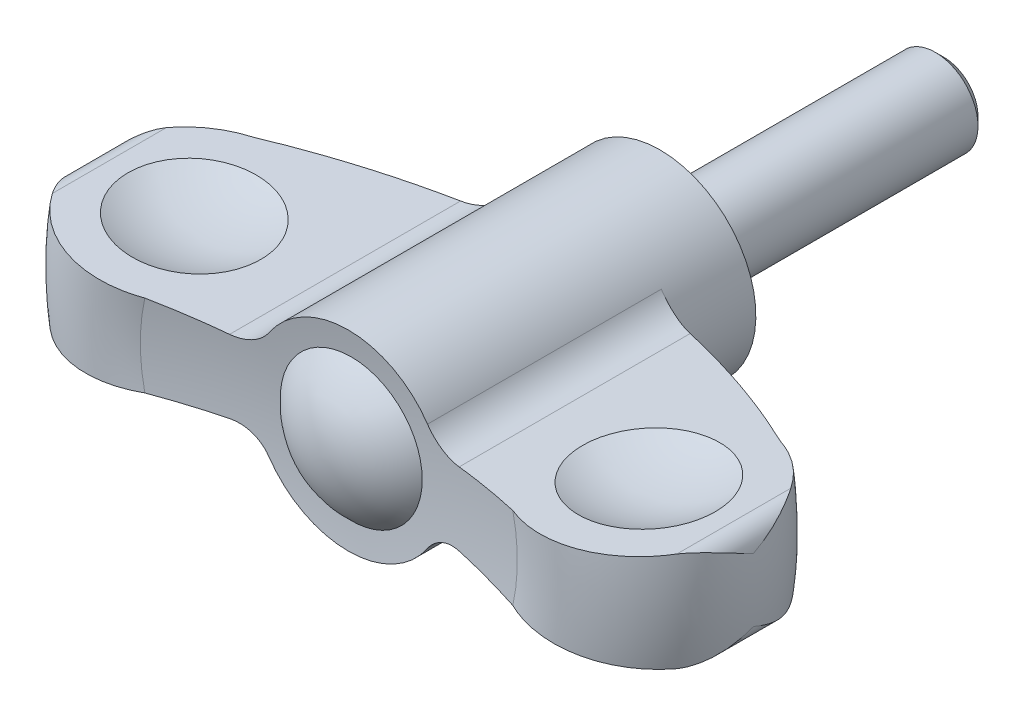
ISO-10303-21;
HEADER;
FILE_DESCRIPTION(('STEP AP214'),'2;1');
FILE_NAME('part.step','',(''),(''),'','','');
FILE_SCHEMA(('AUTOMOTIVE_DESIGN { 1 0 10303 214 1 1 1 1 }'));
ENDSEC;
DATA;
#1=APPLICATION_CONTEXT('core data for automotive mechanical design processes');
#2=APPLICATION_PROTOCOL_DEFINITION('international standard','automotive_design',2000,#1);
#3=PRODUCT_CONTEXT('',#1,'mechanical');
#4=PRODUCT('Part','Part','',(#3));
#5=PRODUCT_RELATED_PRODUCT_CATEGORY('part','',(#4));
#6=PRODUCT_DEFINITION_FORMATION('','',#4);
#7=PRODUCT_DEFINITION_CONTEXT('part definition',#1,'design');
#8=PRODUCT_DEFINITION('design','',#6,#7);
#9=PRODUCT_DEFINITION_SHAPE('','',#8);
#10=(LENGTH_UNIT() NAMED_UNIT(*) SI_UNIT(.MILLI.,.METRE.));
#11=(NAMED_UNIT(*) PLANE_ANGLE_UNIT() SI_UNIT($,.RADIAN.));
#12=(NAMED_UNIT(*) SI_UNIT($,.STERADIAN.) SOLID_ANGLE_UNIT());
#13=UNCERTAINTY_MEASURE_WITH_UNIT(LENGTH_MEASURE(1.E-05),#10,'distance_accuracy_value','');
#14=(GEOMETRIC_REPRESENTATION_CONTEXT(3) GLOBAL_UNCERTAINTY_ASSIGNED_CONTEXT((#13)) GLOBAL_UNIT_ASSIGNED_CONTEXT((#10,
#11,#12)) REPRESENTATION_CONTEXT('',''));
#15=CARTESIAN_POINT('',(0.,0.,0.));
#16=DIRECTION('',(0.,0.,1.));
#17=DIRECTION('',(1.,0.,0.));
#18=AXIS2_PLACEMENT_3D('',#15,#16,#17);
#19=CARTESIAN_POINT('',(0.,0.,60.8916836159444));
#20=DIRECTION('',(0.,0.,1.));
#21=DIRECTION('',(0.,1.,0.));
#22=AXIS2_PLACEMENT_3D('',#19,#20,#21);
#23=DEGENERATE_TOROIDAL_SURFACE('',#22,7.24809636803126,57.1330492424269,.F.);
#24=CARTESIAN_POINT('',(0.,0.,5.5));
#25=DIRECTION('',(0.,0.,1.));
#26=DIRECTION('',(0.,1.,0.));
#27=AXIS2_PLACEMENT_3D('',#24,#25,#26);
#28=CIRCLE('',#27,6.75);
#29=CARTESIAN_POINT('',(5.58468393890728,-3.79128016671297,5.5));
#30=VERTEX_POINT('',#29);
#31=CARTESIAN_POINT('',(5.58468393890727,3.79128016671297,5.5));
#32=VERTEX_POINT('',#31);
#33=EDGE_CURVE('E157',#30,#32,#28,.T.);
#34=ORIENTED_EDGE('',*,*,#33,.T.);
#35=CARTESIAN_POINT('',(5.58454817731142,3.79148016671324,5.5000000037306));
#36=CARTESIAN_POINT('',(5.6270350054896,3.72886637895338,5.49999203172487));
#37=CARTESIAN_POINT('',(5.67207292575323,3.66799067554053,5.50109190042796));
#38=CARTESIAN_POINT('',(5.76687239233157,3.55013742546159,5.50546469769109));
#39=CARTESIAN_POINT('',(5.81663303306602,3.49315913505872,5.5087372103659));
#40=CARTESIAN_POINT('',(5.92037232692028,3.3836500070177,5.51740071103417));
#41=CARTESIAN_POINT('',(5.97433893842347,3.33110730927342,5.5227858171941));
#42=CARTESIAN_POINT('',(6.08617319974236,3.23065312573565,5.53558959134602));
#43=CARTESIAN_POINT('',(6.14404090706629,3.1827417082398,5.54300828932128));
#44=CARTESIAN_POINT('',(6.32281948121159,3.04645743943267,5.56816484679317));
#45=CARTESIAN_POINT('',(6.44903201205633,2.9654018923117,5.58881397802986));
#46=CARTESIAN_POINT('',(6.71175482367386,2.82481579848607,5.63683026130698));
#47=CARTESIAN_POINT('',(6.84827321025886,2.76530241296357,5.66420274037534));
#48=CARTESIAN_POINT('',(7.13180529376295,2.66747892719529,5.72532830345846));
#49=CARTESIAN_POINT('',(7.27900617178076,2.62981214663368,5.75923917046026));
#50=CARTESIAN_POINT('',(7.57631968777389,2.57880440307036,5.83159976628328));
#51=CARTESIAN_POINT('',(7.72642802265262,2.56542990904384,5.87004316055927));
#52=CARTESIAN_POINT('',(7.91146899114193,2.56375196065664,5.91959867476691));
#53=CARTESIAN_POINT('',(7.94691227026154,2.56410633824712,5.92918950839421));
#54=CARTESIAN_POINT('',(8.01766035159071,2.56615563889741,5.94852854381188));
#55=CARTESIAN_POINT('',(8.05296528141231,2.56784856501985,5.958276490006));
#56=CARTESIAN_POINT('',(8.08821506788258,2.57020553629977,5.96810530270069));
#57=B_SPLINE_CURVE_WITH_KNOTS('',3,(#35,#36,#37,#38,#39,#40,#41,#42,#43,#44,#45,#46,#47,#48,#49,
#50,#51,#52,#53,#54,#55,#56),.UNSPECIFIED.,.F.,.F.,(4,2,2,2,2,2,2,2,2,2,4),(0.,
0.226923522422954,0.453803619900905,0.680056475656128,0.906312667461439,1.35828167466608,
1.81060994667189,2.27565813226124,2.74006391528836,2.85020967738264,2.96019142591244),.UNSPECIFIED.);
#58=CARTESIAN_POINT('',(8.08801506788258,2.57019216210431,5.96804953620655));
#59=VERTEX_POINT('',#58);
#60=EDGE_CURVE('E251',#32,#59,#57,.T.);
#61=ORIENTED_EDGE('',*,*,#60,.T.);
#62=CARTESIAN_POINT('',(18.5568278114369,3.2698755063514,10.0639861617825));
#63=CARTESIAN_POINT('',(17.7202118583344,3.21396025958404,9.63606709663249));
#64=CARTESIAN_POINT('',(16.8730027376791,3.15733701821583,9.22898268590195));
#65=CARTESIAN_POINT('',(15.1615683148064,3.04295325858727,8.45851890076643));
#66=CARTESIAN_POINT('',(14.2973907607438,2.98519593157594,8.09503297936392));
#67=CARTESIAN_POINT('',(12.5519653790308,2.86854038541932,7.41164455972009));
#68=CARTESIAN_POINT('',(11.6707170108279,2.80964213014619,7.09174344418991));
#69=CARTESIAN_POINT('',(10.3366076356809,2.72047689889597,6.64515483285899));
#70=CARTESIAN_POINT('',(9.88928279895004,2.6905799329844,6.5016730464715));
#71=CARTESIAN_POINT('',(8.99112522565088,2.63055155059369,6.22618011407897));
#72=CARTESIAN_POINT('',(8.54029244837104,2.6004201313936,6.0941691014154));
#73=CARTESIAN_POINT('',(8.08781506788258,2.57017879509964,5.96799377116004));
#74=B_SPLINE_CURVE_WITH_KNOTS('',3,(#62,#63,#64,#65,#66,#67,#68,#69,#70,#71,#72,#73),
.UNSPECIFIED.,.F.,.F.,(4,2,2,2,2,4),(0.,2.82377208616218,5.64049635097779,8.45730995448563,
9.86934742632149,11.2814013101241),.UNSPECIFIED.);
#75=CARTESIAN_POINT('',(18.5564367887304,3.26984937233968,10.0637861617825));
#76=VERTEX_POINT('',#75);
#77=EDGE_CURVE('E242',#76,#59,#74,.T.);
#78=ORIENTED_EDGE('',*,*,#77,.F.);
#79=CARTESIAN_POINT('',(0.,0.,10.0637861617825));
#80=DIRECTION('',(0.,0.,1.));
#81=DIRECTION('',(0.,1.,0.));
#82=AXIS2_PLACEMENT_3D('',#79,#80,#81);
#83=CIRCLE('',#82,18.8423263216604);
#84=CARTESIAN_POINT('',(18.5564367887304,-3.26984937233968,10.0637861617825));
#85=VERTEX_POINT('',#84);
#86=EDGE_CURVE('E402',#85,#76,#83,.T.);
#87=ORIENTED_EDGE('',*,*,#86,.F.);
#88=CARTESIAN_POINT('',(8.08781506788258,-2.57017879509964,5.96799377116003));
#89=CARTESIAN_POINT('',(8.43648524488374,-2.59348217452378,6.06521586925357));
#90=CARTESIAN_POINT('',(8.78418982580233,-2.6167210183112,6.16591362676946));
#91=CARTESIAN_POINT('',(9.47752423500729,-2.66306003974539,6.37414417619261));
#92=CARTESIAN_POINT('',(9.82315423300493,-2.68616022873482,6.48167640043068));
#93=CARTESIAN_POINT('',(10.8568675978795,-2.7552484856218,6.81439605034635));
#94=CARTESIAN_POINT('',(11.5417095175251,-2.80101991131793,7.04968835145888));
#95=CARTESIAN_POINT('',(13.5766416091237,-2.93702464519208,7.79319141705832));
#96=CARTESIAN_POINT('',(14.9128146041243,-3.02632779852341,8.34061833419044));
#97=CARTESIAN_POINT('',(16.6182429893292,-3.14031014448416,9.11672807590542));
#98=CARTESIAN_POINT('',(17.0086949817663,-3.16640601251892,9.29983650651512));
#99=CARTESIAN_POINT('',(17.785774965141,-3.21834217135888,9.67514693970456));
#100=CARTESIAN_POINT('',(18.1723980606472,-3.24418213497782,9.86735912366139));
#101=CARTESIAN_POINT('',(18.5568278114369,-3.2698755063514,10.0639861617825));
#102=B_SPLINE_CURVE_WITH_KNOTS('',3,(#88,#89,#90,#91,#92,#93,#94,#95,#96,#97,#98,#99,#100,#101),
.UNSPECIFIED.,.F.,.F.,(4,2,2,2,2,2,4),(0.,1.0881425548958,2.17619484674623,4.35250158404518,
8.68743833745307,9.98350841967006,11.2810638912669),.UNSPECIFIED.);
#103=CARTESIAN_POINT('',(8.08801506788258,-2.57019216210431,5.96804953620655));
#104=VERTEX_POINT('',#103);
#105=EDGE_CURVE('E232',#104,#85,#102,.T.);
#106=ORIENTED_EDGE('',*,*,#105,.F.);
#107=CARTESIAN_POINT('',(8.08821506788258,-2.57020553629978,5.96810530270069));
#108=CARTESIAN_POINT('',(8.00997344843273,-2.56497338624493,5.94629000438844));
#109=CARTESIAN_POINT('',(7.9314394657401,-2.5630200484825,5.92486614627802));
#110=CARTESIAN_POINT('',(7.77422277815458,-2.56573749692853,5.88295181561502));
#111=CARTESIAN_POINT('',(7.69554004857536,-2.57040950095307,5.862461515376));
#112=CARTESIAN_POINT('',(7.45993217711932,-2.59446790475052,5.80261995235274));
#113=CARTESIAN_POINT('',(7.30348188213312,-2.62389903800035,5.7649076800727));
#114=CARTESIAN_POINT('',(6.99637317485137,-2.7094115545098,5.69535012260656));
#115=CARTESIAN_POINT('',(6.84572761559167,-2.76554877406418,5.66351732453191));
#116=CARTESIAN_POINT('',(6.55526150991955,-2.90348395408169,5.60733410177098));
#117=CARTESIAN_POINT('',(6.4154250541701,-2.98524327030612,5.58297251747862));
#118=CARTESIAN_POINT('',(6.21564820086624,-3.12665619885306,5.55280138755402));
#119=CARTESIAN_POINT('',(6.14994832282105,-3.17769981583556,5.54373343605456));
#120=CARTESIAN_POINT('',(6.0231628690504,-3.28560819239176,5.52805647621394));
#121=CARTESIAN_POINT('',(5.96207731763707,-3.34247298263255,5.5214474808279));
#122=CARTESIAN_POINT('',(5.84481263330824,-3.46187538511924,5.51078652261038));
#123=CARTESIAN_POINT('',(5.78866161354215,-3.52444182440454,5.50674848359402));
#124=CARTESIAN_POINT('',(5.68213708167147,-3.65444758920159,5.50134928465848));
#125=CARTESIAN_POINT('',(5.63176510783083,-3.72188820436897,5.49998883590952));
#126=CARTESIAN_POINT('',(5.58454817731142,-3.79148016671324,5.50000000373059));
#127=B_SPLINE_CURVE_WITH_KNOTS('',3,(#107,#108,#109,#110,#111,#112,#113,#114,#115,#116,#117,
#118,#119,#120,#121,#122,#123,#124,#125,#126),.UNSPECIFIED.,.F.,.F.,(4,2,2,2,2,2,2,2,2,4),(0.,
0.244043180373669,0.488131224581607,0.976413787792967,1.46572175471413,1.95429525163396,
2.20506346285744,2.4558329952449,2.70794934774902,2.96013265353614),.UNSPECIFIED.);
#128=EDGE_CURVE('E222',#104,#30,#127,.T.);
#129=ORIENTED_EDGE('',*,*,#128,.T.);
#130=EDGE_LOOP('',(#34,#61,#78,#87,#106,#129));
#131=FACE_BOUND('',#130,.T.);
#132=ADVANCED_FACE('F14',(#131),#23,.F.);
#133=CARTESIAN_POINT('',(0.,0.,16.8));
#134=DIRECTION('',(0.,0.,1.));
#135=DIRECTION('',(0.,1.,0.));
#136=AXIS2_PLACEMENT_3D('',#133,#134,#135);
#137=TOROIDAL_SURFACE('',#136,16.3,7.2);
#138=CARTESIAN_POINT('',(-13.4430070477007,-2.92809317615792,10.0635861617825));
#139=CARTESIAN_POINT('',(-13.250045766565,-2.91519660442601,10.1357408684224));
#140=CARTESIAN_POINT('',(-13.0601324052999,-2.90250374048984,10.216071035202));
#141=CARTESIAN_POINT('',(-12.6877100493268,-2.8776128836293,10.3924240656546));
#142=CARTESIAN_POINT('',(-12.5052008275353,-2.86541487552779,10.4884464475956));
#143=CARTESIAN_POINT('',(-12.1489194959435,-2.84160280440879,10.6955091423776));
#144=CARTESIAN_POINT('',(-11.9751456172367,-2.8299886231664,10.8065463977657));
#145=CARTESIAN_POINT('',(-11.6375334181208,-2.8074243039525,11.042874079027));
#146=CARTESIAN_POINT('',(-11.47369496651,-2.79647415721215,11.1681643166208));
#147=CARTESIAN_POINT('',(-11.1570734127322,-2.77531274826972,11.4321870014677));
#148=CARTESIAN_POINT('',(-11.0042945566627,-2.76510176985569,11.5709245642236));
#149=CARTESIAN_POINT('',(-10.7109328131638,-2.74549493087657,11.8608983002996));
#150=CARTESIAN_POINT('',(-10.570354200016,-2.73609935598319,12.0121388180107));
#151=CARTESIAN_POINT('',(-10.3025713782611,-2.7182020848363,12.3259661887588));
#152=CARTESIAN_POINT('',(-10.1753613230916,-2.70969999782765,12.4885480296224));
#153=CARTESIAN_POINT('',(-9.93523518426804,-2.69365116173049,12.8239887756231));
#154=CARTESIAN_POINT('',(-9.82231883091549,-2.68610439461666,12.9968474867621));
#155=CARTESIAN_POINT('',(-9.61240942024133,-2.67207509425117,13.3504168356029));
#156=CARTESIAN_POINT('',(-9.51531257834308,-2.6655856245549,13.5310655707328));
#157=CARTESIAN_POINT('',(-9.33694719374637,-2.6536645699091,13.8999735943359));
#158=CARTESIAN_POINT('',(-9.2556730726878,-2.64823261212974,14.0882301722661));
#159=CARTESIAN_POINT('',(-9.10959731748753,-2.63846963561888,14.4711021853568));
#160=CARTESIAN_POINT('',(-9.0447989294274,-2.63413883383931,14.6657188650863));
#161=CARTESIAN_POINT('',(-8.93227844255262,-2.62661852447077,15.0598492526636));
#162=CARTESIAN_POINT('',(-8.88455601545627,-2.62342899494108,15.2593628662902));
#163=CARTESIAN_POINT('',(-8.80746852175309,-2.61827685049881,15.6574650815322));
#164=CARTESIAN_POINT('',(-8.77773054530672,-2.6162893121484,15.8559812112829));
#165=CARTESIAN_POINT('',(-8.73529826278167,-2.6134533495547,16.2548338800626));
#166=CARTESIAN_POINT('',(-8.7226036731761,-2.61260490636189,16.4551703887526));
#167=CARTESIAN_POINT('',(-8.71437606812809,-2.61205501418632,16.8561671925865));
#168=CARTESIAN_POINT('',(-8.71884052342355,-2.61235339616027,17.0568274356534));
#169=CARTESIAN_POINT('',(-8.74488386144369,-2.61409400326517,17.4570282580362));
#170=CARTESIAN_POINT('',(-8.76646264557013,-2.6155362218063,17.6565688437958));
#171=CARTESIAN_POINT('',(-8.82608238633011,-2.6195209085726,18.0500864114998));
#172=CARTESIAN_POINT('',(-8.86387061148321,-2.62204648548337,18.2441019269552));
#173=CARTESIAN_POINT('',(-8.95554073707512,-2.62817326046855,18.6283441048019));
#174=CARTESIAN_POINT('',(-9.00942811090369,-2.63177482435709,18.8185694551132));
#175=CARTESIAN_POINT('',(-9.13281555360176,-2.64002142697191,19.1937999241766));
#176=CARTESIAN_POINT('',(-9.20231107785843,-2.64466616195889,19.3788065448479));
#177=CARTESIAN_POINT('',(-9.35638258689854,-2.6549635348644,19.742479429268));
#178=CARTESIAN_POINT('',(-9.44096421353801,-2.66061654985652,19.9211432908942));
#179=CARTESIAN_POINT('',(-9.62545322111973,-2.67294687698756,20.2726485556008));
#180=CARTESIAN_POINT('',(-9.72550696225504,-2.6796339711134,20.4454127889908));
#181=CARTESIAN_POINT('',(-9.93957002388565,-2.69394088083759,20.7821124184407));
#182=CARTESIAN_POINT('',(-10.0535844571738,-2.70156103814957,20.9460445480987));
#183=CARTESIAN_POINT('',(-10.2946584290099,-2.71767322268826,21.263898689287));
#184=CARTESIAN_POINT('',(-10.4217143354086,-2.7261650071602,21.4178234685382));
#185=CARTESIAN_POINT('',(-10.688029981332,-2.74396421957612,21.7147703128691));
#186=CARTESIAN_POINT('',(-10.8272940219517,-2.75327193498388,21.8577885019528));
#187=CARTESIAN_POINT('',(-11.1201972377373,-2.77284812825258,22.1349543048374));
#188=CARTESIAN_POINT('',(-11.2740848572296,-2.78313321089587,22.2688382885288));
#189=CARTESIAN_POINT('',(-11.5924511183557,-2.80441122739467,22.5232972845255));
#190=CARTESIAN_POINT('',(-11.7569299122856,-2.81540417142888,22.6438721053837));
#191=CARTESIAN_POINT('',(-12.0953583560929,-2.83802304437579,22.8709220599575));
#192=CARTESIAN_POINT('',(-12.2693100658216,-2.84964911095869,22.9773941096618));
#193=CARTESIAN_POINT('',(-12.6253835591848,-2.87344729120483,23.175449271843));
#194=CARTESIAN_POINT('',(-12.8075027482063,-2.88561923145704,23.2670370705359));
#195=CARTESIAN_POINT('',(-13.1810420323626,-2.9105847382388,23.4357878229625));
#196=CARTESIAN_POINT('',(-13.37255033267,-2.92338419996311,23.5127547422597));
#197=CARTESIAN_POINT('',(-13.7613485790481,-2.94936953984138,23.6502587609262));
#198=CARTESIAN_POINT('',(-13.9586384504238,-2.96255541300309,23.7107960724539));
#199=CARTESIAN_POINT('',(-14.3576152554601,-2.98922103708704,23.8149976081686));
#200=CARTESIAN_POINT('',(-14.5593023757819,-3.00270080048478,23.8586611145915));
#201=CARTESIAN_POINT('',(-14.9656299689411,-3.02985771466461,23.9287762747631));
#202=CARTESIAN_POINT('',(-15.170270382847,-3.04353486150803,23.9552282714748));
#203=CARTESIAN_POINT('',(-15.5810553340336,-3.07098968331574,23.9907056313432));
#204=CARTESIAN_POINT('',(-15.7871999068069,-3.08476736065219,23.9997305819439));
#205=CARTESIAN_POINT('',(-16.1994347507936,-3.11231908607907,24.000257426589));
#206=CARTESIAN_POINT('',(-16.4055250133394,-3.1260931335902,23.9917658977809));
#207=CARTESIAN_POINT('',(-16.816299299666,-3.15354724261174,23.9572980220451));
#208=CARTESIAN_POINT('',(-17.0209829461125,-3.16722727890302,23.9313171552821));
#209=CARTESIAN_POINT('',(-17.4273317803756,-3.19438561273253,23.8620348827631));
#210=CARTESIAN_POINT('',(-17.6289980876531,-3.20786398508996,23.8187400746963));
#211=CARTESIAN_POINT('',(-18.0267250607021,-3.23444607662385,23.7154246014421));
#212=CARTESIAN_POINT('',(-18.2228121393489,-3.24755156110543,23.6555060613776));
#213=CARTESIAN_POINT('',(-18.6091495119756,-3.27337242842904,23.5192613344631));
#214=CARTESIAN_POINT('',(-18.7994018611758,-3.28608794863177,23.4429410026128));
#215=CARTESIAN_POINT('',(-19.1728922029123,-3.31105018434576,23.2743446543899));
#216=CARTESIAN_POINT('',(-19.3561252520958,-3.32329656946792,23.1820576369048));
#217=CARTESIAN_POINT('',(-19.7140940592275,-3.34722142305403,22.9822113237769));
#218=CARTESIAN_POINT('',(-19.8888301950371,-3.35889991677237,22.8746527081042));
#219=CARTESIAN_POINT('',(-20.2275235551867,-3.38153649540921,22.6457025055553));
#220=CARTESIAN_POINT('',(-20.3915386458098,-3.39249844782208,22.5243968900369));
#221=CARTESIAN_POINT('',(-20.7087215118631,-3.41369737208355,22.2682963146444));
#222=CARTESIAN_POINT('',(-20.8618896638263,-3.42393436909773,22.133501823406));
#223=CARTESIAN_POINT('',(-21.1559703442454,-3.44358925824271,21.851664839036));
#224=CARTESIAN_POINT('',(-21.296906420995,-3.45300872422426,21.704646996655));
#225=CARTESIAN_POINT('',(-21.565777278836,-3.47097871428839,21.3992346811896));
#226=CARTESIAN_POINT('',(-21.6937203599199,-3.47952979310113,21.240847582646));
#227=CARTESIAN_POINT('',(-21.8466005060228,-3.48974754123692,21.0342564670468));
#228=CARTESIAN_POINT('',(-21.8780226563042,-3.49184764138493,20.9907857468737));
#229=CARTESIAN_POINT('',(-21.9398602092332,-3.49598055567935,20.9031903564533));
#230=CARTESIAN_POINT('',(-21.9702765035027,-3.49801342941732,20.8590663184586));
#231=CARTESIAN_POINT('',(-22.0002000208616,-3.50001336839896,20.8146028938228));
#232=B_SPLINE_CURVE_WITH_KNOTS('',3,(#138,#139,#140,#141,#142,#143,#144,#145,#146,#147,#148,
#149,#150,#151,#152,#153,#154,#155,#156,#157,#158,#159,#160,#161,#162,#163,#164,#165,#166,#167,
#168,#169,#170,#171,#172,#173,#174,#175,#176,#177,#178,#179,#180,#181,#182,#183,#184,#185,#186,
#187,#188,#189,#190,#191,#192,#193,#194,#195,#196,#197,#198,#199,#200,#201,#202,#203,#204,#205,
#206,#207,#208,#209,#210,#211,#212,#213,#214,#215,#216,#217,#218,#219,#220,#221,#222,#223,#224,
#225,#226,#227,#228,#229,#230,#231),.UNSPECIFIED.,.F.,.F.,(4,2,2,2,2,2,2,2,2,2,2,2,2,2,2,2,2,2,
2,2,2,2,2,2,2,2,2,2,2,2,2,2,2,2,2,2,2,2,2,2,2,2,2,2,2,2,4),(0.,0.619053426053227,
1.23808785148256,1.85699641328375,2.47589680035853,3.09503355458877,3.71438635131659,
4.33346714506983,4.95253625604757,5.56736438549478,6.18197536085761,6.79670733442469,
7.41142748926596,8.01292036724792,8.61440323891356,9.21579745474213,9.81718820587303,
10.4095249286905,11.0020632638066,11.5944292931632,12.1870173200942,12.7855991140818,
13.3844007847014,13.9830361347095,14.5818832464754,15.1938756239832,15.8058768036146,
16.4180115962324,17.029953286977,17.6495959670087,18.2692306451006,18.8888916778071,
19.5085403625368,20.1282037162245,20.7476344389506,21.3672253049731,21.9865802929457,
22.6022115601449,23.217623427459,23.8334610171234,24.4492711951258,25.0614231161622,
25.6735537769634,26.2844785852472,26.8950106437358,27.0560402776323,27.216923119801),.UNSPECIFIED.);
#233=CARTESIAN_POINT('',(-12.9627653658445,-2.89599621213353,23.3370956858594));
#234=VERTEX_POINT('',#233);
#235=CARTESIAN_POINT('',(-22.0000000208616,-3.5,20.8149000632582));
#236=VERTEX_POINT('',#235);
#237=EDGE_CURVE('E276',#234,#236,#232,.T.);
#238=ORIENTED_EDGE('',*,*,#237,.F.);
#239=CARTESIAN_POINT('',(0.,0.,23.3370956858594));
#240=DIRECTION('',(0.,0.,1.));
#241=DIRECTION('',(0.,1.,0.));
#242=AXIS2_PLACEMENT_3D('',#239,#240,#241);
#243=CIRCLE('',#242,13.2823220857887);
#244=CARTESIAN_POINT('',(-12.9627653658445,2.89599621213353,23.3370956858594));
#245=VERTEX_POINT('',#244);
#246=EDGE_CURVE('E210',#245,#234,#243,.T.);
#247=ORIENTED_EDGE('',*,*,#246,.F.);
#248=CARTESIAN_POINT('',(-22.0002,3.50001336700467,20.8146029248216));
#249=CARTESIAN_POINT('',(-21.8869659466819,3.49244536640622,20.9829001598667));
#250=CARTESIAN_POINT('',(-21.7665908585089,3.48440009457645,21.1463645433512));
#251=CARTESIAN_POINT('',(-21.5125154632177,3.46741895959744,21.4625195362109));
#252=CARTESIAN_POINT('',(-21.378816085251,3.45848315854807,21.6152108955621));
#253=CARTESIAN_POINT('',(-21.0991608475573,3.43979239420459,21.9086013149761));
#254=CARTESIAN_POINT('',(-20.9532163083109,3.43003818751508,22.0493112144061));
#255=CARTESIAN_POINT('',(-20.6500231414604,3.4097742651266,22.3179109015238));
#256=CARTESIAN_POINT('',(-20.4927745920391,3.399264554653,22.445800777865));
#257=CARTESIAN_POINT('',(-20.1680719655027,3.377563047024,22.6878898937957));
#258=CARTESIAN_POINT('',(-20.0006161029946,3.36637113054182,22.8020867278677));
#259=CARTESIAN_POINT('',(-19.6566594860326,3.34338278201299,23.0160136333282));
#260=CARTESIAN_POINT('',(-19.4801554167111,3.33158612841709,23.1157383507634));
#261=CARTESIAN_POINT('',(-19.1195107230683,3.3074824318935,23.299940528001));
#262=CARTESIAN_POINT('',(-18.9353740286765,3.29517565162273,23.3844257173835));
#263=CARTESIAN_POINT('',(-18.5606181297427,3.27012883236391,23.5376689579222));
#264=CARTESIAN_POINT('',(-18.369996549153,3.25738863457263,23.6064211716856));
#265=CARTESIAN_POINT('',(-17.9830362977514,3.23152613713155,23.7279050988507));
#266=CARTESIAN_POINT('',(-17.7866806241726,3.21840270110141,23.780582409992));
#267=CARTESIAN_POINT('',(-17.3901835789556,3.19190281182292,23.8692781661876));
#268=CARTESIAN_POINT('',(-17.1900408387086,3.17852626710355,23.9052904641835));
#269=CARTESIAN_POINT('',(-16.7874574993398,3.15161960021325,23.9604036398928));
#270=CARTESIAN_POINT('',(-16.5850169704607,3.13808948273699,23.9795050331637));
#271=CARTESIAN_POINT('',(-16.1792478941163,3.11096989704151,24.0006952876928));
#272=CARTESIAN_POINT('',(-15.9759193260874,3.09738042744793,24.0027837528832));
#273=CARTESIAN_POINT('',(-15.5684666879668,3.07014832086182,23.9899203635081));
#274=CARTESIAN_POINT('',(-15.364346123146,3.05650591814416,23.9748568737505));
#275=CARTESIAN_POINT('',(-14.9580777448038,3.02935296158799,23.9276425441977));
#276=CARTESIAN_POINT('',(-14.755929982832,3.01584241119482,23.8954912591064));
#277=CARTESIAN_POINT('',(-14.3550670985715,2.98905073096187,23.814360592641));
#278=CARTESIAN_POINT('',(-14.1563513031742,2.97576955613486,23.7653845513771));
#279=CARTESIAN_POINT('',(-13.7636331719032,2.94952223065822,23.6509482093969));
#280=CARTESIAN_POINT('',(-13.5696323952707,2.9365561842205,23.5854825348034));
#281=CARTESIAN_POINT('',(-13.1865164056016,2.91095061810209,23.4380671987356));
#282=CARTESIAN_POINT('',(-12.9974412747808,2.89831377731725,23.356012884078));
#283=CARTESIAN_POINT('',(-12.6268363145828,2.87354438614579,23.1762764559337));
#284=CARTESIAN_POINT('',(-12.4453065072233,2.86141183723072,23.078594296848));
#285=CARTESIAN_POINT('',(-12.0910342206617,2.83773404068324,22.8682633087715));
#286=CARTESIAN_POINT('',(-11.9182938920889,2.8261889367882,22.7556108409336));
#287=CARTESIAN_POINT('',(-11.5829402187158,2.80377556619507,22.516182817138));
#288=CARTESIAN_POINT('',(-11.4203233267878,2.79290706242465,22.3894122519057));
#289=CARTESIAN_POINT('',(-11.1059013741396,2.77189266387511,22.1222291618));
#290=CARTESIAN_POINT('',(-10.9541266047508,2.76174879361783,21.9817808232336));
#291=CARTESIAN_POINT('',(-10.6630509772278,2.74229474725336,21.6885550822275));
#292=CARTESIAN_POINT('',(-10.5237454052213,2.73298425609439,21.5357823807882));
#293=CARTESIAN_POINT('',(-10.2585504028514,2.71525994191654,21.2188580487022));
#294=CARTESIAN_POINT('',(-10.1326659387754,2.7068464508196,21.0547022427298));
#295=CARTESIAN_POINT('',(-9.89540453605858,2.69098907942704,20.7162706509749));
#296=CARTESIAN_POINT('',(-9.78402188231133,2.68354481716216,20.5419988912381));
#297=CARTESIAN_POINT('',(-9.57753567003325,2.66974430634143,20.1860989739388));
#298=CARTESIAN_POINT('',(-9.48229586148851,2.66337895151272,20.0045502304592));
#299=CARTESIAN_POINT('',(-9.30772151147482,2.65171127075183,19.6340070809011));
#300=CARTESIAN_POINT('',(-9.22838099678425,2.64640854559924,19.445015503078));
#301=CARTESIAN_POINT('',(-9.0862443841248,2.6369088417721,19.0608700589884));
#302=CARTESIAN_POINT('',(-9.02344908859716,2.63271191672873,18.8657158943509));
#303=CARTESIAN_POINT('',(-8.91497467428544,2.62546202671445,18.4706862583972));
#304=CARTESIAN_POINT('',(-8.86929523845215,2.62240904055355,18.2708108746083));
#305=CARTESIAN_POINT('',(-8.79627719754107,2.61752887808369,17.8722020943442));
#306=CARTESIAN_POINT('',(-8.76856256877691,2.61567657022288,17.6735378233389));
#307=CARTESIAN_POINT('',(-8.73017446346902,2.61311090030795,17.2745631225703));
#308=CARTESIAN_POINT('',(-8.71950071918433,2.61239752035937,17.0742527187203));
#309=CARTESIAN_POINT('',(-8.71529310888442,2.61211630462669,16.6734663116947));
#310=CARTESIAN_POINT('',(-8.72175798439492,2.61254838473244,16.4729903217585));
#311=CARTESIAN_POINT('',(-8.75176494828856,2.61455390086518,16.0733272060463));
#312=CARTESIAN_POINT('',(-8.77530694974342,2.61612733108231,15.8741400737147));
#313=CARTESIAN_POINT('',(-8.83878915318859,2.62037016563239,15.481363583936));
#314=CARTESIAN_POINT('',(-8.87848770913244,2.62302341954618,15.2877349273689));
#315=CARTESIAN_POINT('',(-8.97393104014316,2.62940237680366,14.9044232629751));
#316=CARTESIAN_POINT('',(-9.029681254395,2.6331284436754,14.7147416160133));
#317=CARTESIAN_POINT('',(-9.15673580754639,2.64162013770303,14.3407362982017));
#318=CARTESIAN_POINT('',(-9.2280365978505,2.64638552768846,14.1564114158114));
#319=CARTESIAN_POINT('',(-9.38562068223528,2.65691766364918,13.7943056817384));
#320=CARTESIAN_POINT('',(-9.47190458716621,2.66268445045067,13.6165250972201));
#321=CARTESIAN_POINT('',(-9.65980249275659,2.67524261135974,13.2667770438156));
#322=CARTESIAN_POINT('',(-9.76157423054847,2.68204452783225,13.094894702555));
#323=CARTESIAN_POINT('',(-9.97895442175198,2.69657313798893,12.7601587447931));
#324=CARTESIAN_POINT('',(-10.094562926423,2.70429983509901,12.5973051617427));
#325=CARTESIAN_POINT('',(-10.3388280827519,2.72062530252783,12.28159984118));
#326=CARTESIAN_POINT('',(-10.4674919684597,2.72922455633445,12.1287537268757));
#327=CARTESIAN_POINT('',(-10.7368892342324,2.74722972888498,11.8341521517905));
#328=CARTESIAN_POINT('',(-10.8776225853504,2.75663564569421,11.6923966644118));
#329=CARTESIAN_POINT('',(-11.1735584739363,2.77641452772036,11.4177499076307));
#330=CARTESIAN_POINT('',(-11.3290201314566,2.78680481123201,11.2851390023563));
#331=CARTESIAN_POINT('',(-11.6503816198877,2.80828301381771,11.0334204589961));
#332=CARTESIAN_POINT('',(-11.8162777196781,2.81937068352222,10.914308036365));
#333=CARTESIAN_POINT('',(-12.1571151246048,2.8421505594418,10.690516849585));
#334=CARTESIAN_POINT('',(-12.3320419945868,2.85384180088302,10.5858159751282));
#335=CARTESIAN_POINT('',(-12.6898958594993,2.87775897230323,10.3913862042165));
#336=CARTESIAN_POINT('',(-12.8728180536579,2.88998458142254,10.3016484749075));
#337=CARTESIAN_POINT('',(-13.1223586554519,2.90666263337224,10.1918600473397));
#338=CARTESIAN_POINT('',(-13.1860214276,2.9109175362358,10.1649193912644));
#339=CARTESIAN_POINT('',(-13.3140099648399,2.91947165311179,10.1128788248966));
#340=CARTESIAN_POINT('',(-13.3783349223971,2.92377081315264,10.0877769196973));
#341=CARTESIAN_POINT('',(-13.4430070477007,2.92809317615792,10.0635861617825));
#342=B_SPLINE_CURVE_WITH_KNOTS('',3,(#248,#249,#250,#251,#252,#253,#254,#255,#256,#257,#258,
#259,#260,#261,#262,#263,#264,#265,#266,#267,#268,#269,#270,#271,#272,#273,#274,#275,#276,#277,
#278,#279,#280,#281,#282,#283,#284,#285,#286,#287,#288,#289,#290,#291,#292,#293,#294,#295,#296,
#297,#298,#299,#300,#301,#302,#303,#304,#305,#306,#307,#308,#309,#310,#311,#312,#313,#314,#315,
#316,#317,#318,#319,#320,#321,#322,#323,#324,#325,#326,#327,#328,#329,#330,#331,#332,#333,#334,
#335,#336,#337,#338,#339,#340,#341),.UNSPECIFIED.,.F.,.F.,(4,2,2,2,2,2,2,2,2,2,2,2,2,2,2,2,2,2,
2,2,2,2,2,2,2,2,2,2,2,2,2,2,2,2,2,2,2,2,2,2,2,2,2,2,2,2,4),(0.,0.608767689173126,
1.21749295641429,1.82566153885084,2.43382591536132,3.04209697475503,3.65059249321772,
4.25877850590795,4.86718980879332,5.47763788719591,6.08831095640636,6.698965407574,
7.30963407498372,7.92430017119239,8.53898228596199,9.15354244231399,9.76830314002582,
10.387070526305,11.0058397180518,11.6247595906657,12.2434613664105,12.8638290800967,
13.4839612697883,14.1043221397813,14.7244377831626,15.3390262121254,15.9533833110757,
16.5677702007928,17.1821457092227,17.7832066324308,18.3842581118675,18.9852654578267,
19.5862697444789,20.1785973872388,20.7711259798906,21.3635195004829,21.9559371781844,
22.5548514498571,23.1537679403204,23.7530181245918,24.3522668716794,24.9653566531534,
25.5782284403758,26.1901492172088,26.8017074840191,27.0094652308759,27.2169941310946),.UNSPECIFIED.);
#343=CARTESIAN_POINT('',(-22.,3.5,20.8149000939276));
#344=VERTEX_POINT('',#343);
#345=EDGE_CURVE('E298',#344,#245,#342,.T.);
#346=ORIENTED_EDGE('',*,*,#345,.F.);
#347=CARTESIAN_POINT('',(-23.3936651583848,2.23303167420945,16.8));
#348=CARTESIAN_POINT('',(-23.3934426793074,2.23536251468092,16.8051493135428));
#349=CARTESIAN_POINT('',(-23.3932143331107,2.23769289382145,16.8102988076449));
#350=CARTESIAN_POINT('',(-23.3743145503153,2.42570445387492,17.2258528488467));
#351=CARTESIAN_POINT('',(-23.3183956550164,2.60830531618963,17.6373544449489));
#352=CARTESIAN_POINT('',(-23.1798743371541,2.85965877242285,18.2505518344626));
#353=CARTESIAN_POINT('',(-23.1245479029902,2.939723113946,18.4543861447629));
#354=CARTESIAN_POINT('',(-22.9956909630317,3.08909813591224,18.8603432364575));
#355=CARTESIAN_POINT('',(-22.9221687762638,3.1584137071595,19.0624667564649));
#356=CARTESIAN_POINT('',(-22.7850793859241,3.26116367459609,19.3959296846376));
#357=CARTESIAN_POINT('',(-22.7265638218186,3.29880232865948,19.5280746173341));
#358=CARTESIAN_POINT('',(-22.6018254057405,3.36602668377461,19.7906656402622));
#359=CARTESIAN_POINT('',(-22.5356088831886,3.39561893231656,19.9211130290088));
#360=CARTESIAN_POINT('',(-22.395316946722,3.44509635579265,20.180513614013));
#361=CARTESIAN_POINT('',(-22.3212053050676,3.46493421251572,20.3094566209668));
#362=CARTESIAN_POINT('',(-22.2046559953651,3.48552373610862,20.500765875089));
#363=CARTESIAN_POINT('',(-22.1648550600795,3.49085996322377,20.5642643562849));
#364=CARTESIAN_POINT('',(-22.0835651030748,3.49809816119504,20.6904076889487));
#365=CARTESIAN_POINT('',(-22.0420753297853,3.49999858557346,20.7530521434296));
#366=CARTESIAN_POINT('',(-21.9998,3.49999998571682,20.8151941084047));
#367=B_SPLINE_CURVE_WITH_KNOTS('',3,(#347,#348,#349,#350,#351,#352,#353,#354,#355,#356,#357,
#358,#359,#360,#361,#362,#363,#364,#365,#366),.UNSPECIFIED.,.F.,.F.,(4,2,2,2,2,2,2,2,2,4),(0.,
0.016970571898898,1.36944581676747,2.04642868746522,2.72310261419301,3.17077232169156,
3.61807665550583,4.06752995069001,4.29283181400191,4.51823506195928),.UNSPECIFIED.);
#368=CARTESIAN_POINT('',(-23.3936651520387,2.23303174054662,16.8));
#369=VERTEX_POINT('',#368);
#370=EDGE_CURVE('E360',#369,#344,#367,.T.);
#371=ORIENTED_EDGE('',*,*,#370,.F.);
#372=CARTESIAN_POINT('',(-21.9998,3.49999998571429,12.7848058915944));
#373=CARTESIAN_POINT('',(-22.0666741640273,3.49996244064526,12.8830879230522));
#374=CARTESIAN_POINT('',(-22.1315514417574,3.4952325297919,12.9826100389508));
#375=CARTESIAN_POINT('',(-22.2568815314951,3.47769367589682,13.1835115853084));
#376=CARTESIAN_POINT('',(-22.3173409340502,3.46489705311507,13.2848879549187));
#377=CARTESIAN_POINT('',(-22.4333648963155,3.43259083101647,13.4887461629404));
#378=CARTESIAN_POINT('',(-22.4889490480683,3.41310980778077,13.5912215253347));
#379=CARTESIAN_POINT('',(-22.5953729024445,3.3684102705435,13.7974289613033));
#380=CARTESIAN_POINT('',(-22.6462099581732,3.34318858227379,13.9011616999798));
#381=CARTESIAN_POINT('',(-22.774089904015,3.2701146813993,14.1765334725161));
#382=CARTESIAN_POINT('',(-22.8470051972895,3.21812877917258,14.3490158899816));
#383=CARTESIAN_POINT('',(-22.9794561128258,3.10414337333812,14.695745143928));
#384=CARTESIAN_POINT('',(-23.0389856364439,3.04213932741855,14.8699927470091));
#385=CARTESIAN_POINT('',(-23.1975205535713,2.84462859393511,15.3951794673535));
#386=CARTESIAN_POINT('',(-23.2763283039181,2.6977147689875,15.7482515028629));
#387=CARTESIAN_POINT('',(-23.3443046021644,2.49442989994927,16.2153989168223));
#388=CARTESIAN_POINT('',(-23.3580236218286,2.44419371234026,16.3292368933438));
#389=CARTESIAN_POINT('',(-23.3797700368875,2.34273549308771,16.5569077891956));
#390=CARTESIAN_POINT('',(-23.3878040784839,2.29151468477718,16.6707405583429));
#391=CARTESIAN_POINT('',(-23.3932143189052,2.23769296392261,16.7897010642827));
#392=CARTESIAN_POINT('',(-23.3934426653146,2.23536258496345,16.7948505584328));
#393=CARTESIAN_POINT('',(-23.3936651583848,2.23303167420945,16.8));
#394=B_SPLINE_CURVE_WITH_KNOTS('',3,(#372,#373,#374,#375,#376,#377,#378,#379,#380,#381,#382,
#383,#384,#385,#386,#387,#388,#389,#390,#391,#392,#393),.UNSPECIFIED.,.F.,.F.,(4,2,2,2,2,2,2,2,
2,2,4),(0.,0.356372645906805,0.712202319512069,1.06652937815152,1.42105283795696,
2.00316709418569,2.58554603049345,3.75135617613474,4.12686584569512,4.5019357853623,
4.51890635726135),.UNSPECIFIED.);
#395=CARTESIAN_POINT('',(-22.,3.5,12.7850999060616));
#396=VERTEX_POINT('',#395);
#397=EDGE_CURVE('E354',#396,#369,#394,.T.);
#398=ORIENTED_EDGE('',*,*,#397,.F.);
#399=CARTESIAN_POINT('',(-18.5559048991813,3.26981382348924,10.0635861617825));
#400=CARTESIAN_POINT('',(-18.7481532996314,3.28266274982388,10.1358408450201));
#401=CARTESIAN_POINT('',(-18.9373210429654,3.29530578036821,10.2163336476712));
#402=CARTESIAN_POINT('',(-19.308161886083,3.32009093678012,10.3931469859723));
#403=CARTESIAN_POINT('',(-19.4898343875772,3.332233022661,10.4894687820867));
#404=CARTESIAN_POINT('',(-19.8398224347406,3.35562448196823,10.6946430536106));
#405=CARTESIAN_POINT('',(-20.0083599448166,3.36688869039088,10.8031155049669));
#406=CARTESIAN_POINT('',(-20.3358278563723,3.38877501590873,11.0337190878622));
#407=CARTESIAN_POINT('',(-20.4947599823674,3.39939724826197,11.1558477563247));
#408=CARTESIAN_POINT('',(-20.7764213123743,3.41822208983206,11.3915935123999));
#409=CARTESIAN_POINT('',(-20.9007819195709,3.42653373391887,11.5032605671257));
#410=CARTESIAN_POINT('',(-21.141456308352,3.44261921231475,11.7349898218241));
#411=CARTESIAN_POINT('',(-21.2577703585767,3.45039306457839,11.8550517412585));
#412=CARTESIAN_POINT('',(-21.4842055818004,3.46552686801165,12.105686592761));
#413=CARTESIAN_POINT('',(-21.5941379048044,3.47287419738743,12.2364309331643));
#414=CARTESIAN_POINT('',(-21.8044661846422,3.48693149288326,12.5054420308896));
#415=CARTESIAN_POINT('',(-21.9048606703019,3.49364136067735,12.6437099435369));
#416=CARTESIAN_POINT('',(-22.0002,3.50001336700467,12.7853970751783));
#417=B_SPLINE_CURVE_WITH_KNOTS('',3,(#399,#400,#401,#402,#403,#404,#405,#406,#407,#408,#409,
#410,#411,#412,#413,#414,#415,#416),.UNSPECIFIED.,.F.,.F.,(4,2,2,2,2,2,2,2,4),(0.,
0.617158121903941,1.23436541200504,1.83590974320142,2.43734575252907,2.93898887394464,
3.44061523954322,3.95311321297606,4.46569010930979),.UNSPECIFIED.);
#418=CARTESIAN_POINT('',(-18.5564367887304,3.26984937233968,10.0637861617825));
#419=VERTEX_POINT('',#418);
#420=EDGE_CURVE('E277',#419,#396,#417,.T.);
#421=ORIENTED_EDGE('',*,*,#420,.F.);
#422=CARTESIAN_POINT('',(-18.5564367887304,-3.26984937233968,10.0637861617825));
#423=VERTEX_POINT('',#422);
#424=EDGE_CURVE('E399',#419,#423,#83,.T.);
#425=ORIENTED_EDGE('',*,*,#424,.T.);
#426=CARTESIAN_POINT('',(-22.0002000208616,-3.50001336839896,12.7853971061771));
#427=CARTESIAN_POINT('',(-21.8855721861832,-3.49235221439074,12.6150255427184));
#428=CARTESIAN_POINT('',(-21.7636225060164,-3.48420170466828,12.4496052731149));
#429=CARTESIAN_POINT('',(-21.5060663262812,-3.46698793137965,12.1298039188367));
#430=CARTESIAN_POINT('',(-21.3704594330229,-3.45792464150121,11.9754231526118));
#431=CARTESIAN_POINT('',(-21.0901761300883,-3.43919190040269,11.6826018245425));
#432=CARTESIAN_POINT('',(-20.9458162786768,-3.42954360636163,11.5438566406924));
#433=CARTESIAN_POINT('',(-20.6460984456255,-3.4095119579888,11.2788991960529));
#434=CARTESIAN_POINT('',(-20.4907422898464,-3.39912872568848,11.1526848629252));
#435=CARTESIAN_POINT('',(-20.1963110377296,-3.3794504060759,10.9331636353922));
#436=CARTESIAN_POINT('',(-20.058720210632,-3.37025451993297,10.8378487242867));
#437=CARTESIAN_POINT('',(-19.7772660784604,-3.35144352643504,10.6570247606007));
#438=CARTESIAN_POINT('',(-19.6334029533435,-3.34182843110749,10.571515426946));
#439=CARTESIAN_POINT('',(-19.3369202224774,-3.32201300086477,10.4089623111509));
#440=CARTESIAN_POINT('',(-19.1841783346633,-3.31180449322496,10.3321425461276));
#441=CARTESIAN_POINT('',(-18.8736362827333,-3.29104940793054,10.1895126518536));
#442=CARTESIAN_POINT('',(-18.7158354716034,-3.28050278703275,10.123703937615));
#443=CARTESIAN_POINT('',(-18.5559048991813,-3.26981382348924,10.0635861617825));
#444=B_SPLINE_CURVE_WITH_KNOTS('',3,(#426,#427,#428,#429,#430,#431,#432,#433,#434,#435,#436,
#437,#438,#439,#440,#441,#442,#443),.UNSPECIFIED.,.F.,.F.,(4,2,2,2,2,2,2,2,4),(0.,
0.616269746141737,1.23255726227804,1.83324114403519,2.43382551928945,2.93633271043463,
3.43882549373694,3.95222439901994,4.46568922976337),.UNSPECIFIED.);
#445=CARTESIAN_POINT('',(-22.0000000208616,-3.5,12.7850999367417));
#446=VERTEX_POINT('',#445);
#447=EDGE_CURVE('E530',#446,#423,#444,.T.);
#448=ORIENTED_EDGE('',*,*,#447,.F.);
#449=CARTESIAN_POINT('',(-23.3936651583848,-2.23303167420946,16.8));
#450=CARTESIAN_POINT('',(-23.3934426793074,-2.23536251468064,16.794850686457));
#451=CARTESIAN_POINT('',(-23.3932143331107,-2.23769289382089,16.7897011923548));
#452=CARTESIAN_POINT('',(-23.3743145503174,-2.42570445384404,16.374147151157));
#453=CARTESIAN_POINT('',(-23.3183956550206,-2.60830531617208,15.9626455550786));
#454=CARTESIAN_POINT('',(-23.1798743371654,-2.85965877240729,15.349448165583));
#455=CARTESIAN_POINT('',(-23.1245479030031,-2.93972311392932,15.1456138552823));
#456=CARTESIAN_POINT('',(-22.9956909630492,-3.0890981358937,14.739656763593));
#457=CARTESIAN_POINT('',(-22.922168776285,-3.15841370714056,14.5375332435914));
#458=CARTESIAN_POINT('',(-22.7850793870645,-3.26116367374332,14.2040703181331));
#459=CARTESIAN_POINT('',(-22.7265638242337,-3.29880232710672,14.0719253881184));
#460=CARTESIAN_POINT('',(-22.6018254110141,-3.36602668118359,13.8093343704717));
#461=CARTESIAN_POINT('',(-22.5356088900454,-3.39561892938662,13.6788869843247));
#462=CARTESIAN_POINT('',(-22.3953169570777,-3.44509635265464,13.4194864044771));
#463=CARTESIAN_POINT('',(-22.3212053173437,-3.46493420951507,13.2905434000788));
#464=CARTESIAN_POINT('',(-22.2046560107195,-3.48552373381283,13.0992341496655));
#465=CARTESIAN_POINT('',(-22.1648550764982,-3.49085996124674,13.035735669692));
#466=CARTESIAN_POINT('',(-22.083565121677,-3.49809816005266,12.9095923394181));
#467=CARTESIAN_POINT('',(-22.0420753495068,-3.49999858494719,12.8469478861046));
#468=CARTESIAN_POINT('',(-21.9998000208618,-3.4999999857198,12.784805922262));
#469=B_SPLINE_CURVE_WITH_KNOTS('',3,(#449,#450,#451,#452,#453,#454,#455,#456,#457,#458,#459,
#460,#461,#462,#463,#464,#465,#466,#467,#468),.UNSPECIFIED.,.F.,.F.,(4,2,2,2,2,2,2,2,2,4),(0.,
0.0169705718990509,1.36944581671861,2.0464286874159,2.72310261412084,3.17077231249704,
3.61807663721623,4.06752992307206,4.29283178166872,4.51823502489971),.UNSPECIFIED.);
#470=CARTESIAN_POINT('',(-23.393665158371,-2.23303167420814,16.8));
#471=VERTEX_POINT('',#470);
#472=EDGE_CURVE('E372',#471,#446,#469,.T.);
#473=ORIENTED_EDGE('',*,*,#472,.F.);
#474=CARTESIAN_POINT('',(-21.9998000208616,-3.49999998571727,20.8151940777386));
#475=CARTESIAN_POINT('',(-22.0666741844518,-3.49996243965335,20.7169120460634));
#476=CARTESIAN_POINT('',(-22.1315514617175,-3.49523252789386,20.617389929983));
#477=CARTESIAN_POINT('',(-22.2568815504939,-3.47769367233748,20.4164883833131));
#478=CARTESIAN_POINT('',(-22.3173409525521,-3.46489704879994,20.315112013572));
#479=CARTESIAN_POINT('',(-22.4333649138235,-3.43259082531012,20.111253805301));
#480=CARTESIAN_POINT('',(-22.488949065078,-3.41310980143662,20.0087784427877));
#481=CARTESIAN_POINT('',(-22.5953729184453,-3.36841026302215,19.802571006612));
#482=CARTESIAN_POINT('',(-22.6462099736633,-3.34318857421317,19.6988382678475));
#483=CARTESIAN_POINT('',(-22.7740899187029,-3.27011467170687,19.4234664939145));
#484=CARTESIAN_POINT('',(-22.8470052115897,-3.21812876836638,19.2509840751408));
#485=CARTESIAN_POINT('',(-22.9794561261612,-3.10414336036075,18.9042548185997));
#486=CARTESIAN_POINT('',(-23.0389856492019,-3.04213931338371,18.7300072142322));
#487=CARTESIAN_POINT('',(-23.1975205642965,-2.84462857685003,18.2048204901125));
#488=CARTESIAN_POINT('',(-23.2763283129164,-2.69771475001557,17.8517484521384));
#489=CARTESIAN_POINT('',(-23.3443046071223,-2.49442988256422,17.3846010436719));
#490=CARTESIAN_POINT('',(-23.3580236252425,-2.44419369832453,17.2707630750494));
#491=CARTESIAN_POINT('',(-23.379770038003,-2.34273548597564,17.0430921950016));
#492=CARTESIAN_POINT('',(-23.3878040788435,-2.29151468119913,16.9292594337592));
#493=CARTESIAN_POINT('',(-23.3932143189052,-2.23769296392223,16.8102989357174));
#494=CARTESIAN_POINT('',(-23.3934426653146,-2.23536258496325,16.8051494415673));
#495=CARTESIAN_POINT('',(-23.3936651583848,-2.23303167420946,16.8));
#496=B_SPLINE_CURVE_WITH_KNOTS('',3,(#474,#475,#476,#477,#478,#479,#480,#481,#482,#483,#484,
#485,#486,#487,#488,#489,#490,#491,#492,#493,#494,#495),.UNSPECIFIED.,.F.,.F.,(4,2,2,2,2,2,2,2,
2,2,4),(0.,0.356372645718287,0.712202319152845,1.0665293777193,1.42105283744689,
2.00316709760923,2.58554603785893,3.75135619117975,4.12686583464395,4.50193574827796,
4.51890632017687),.UNSPECIFIED.);
#497=EDGE_CURVE('E366',#236,#471,#496,.T.);
#498=ORIENTED_EDGE('',*,*,#497,.F.);
#499=EDGE_LOOP('',(#238,#247,#346,#371,#398,#421,#425,#448,#473,#498));
#500=FACE_BOUND('',#499,.T.);
#501=ADVANCED_FACE('F391',(#500),#137,.T.);
#502=CARTESIAN_POINT('',(0.,0.,0.));
#503=DIRECTION('',(0.,0.,1.));
#504=DIRECTION('',(0.,1.,0.));
#505=AXIS2_PLACEMENT_3D('',#502,#503,#504);
#506=PLANE('',#505);
#507=CARTESIAN_POINT('',(0.,0.,0.));
#508=DIRECTION('',(0.,0.,1.));
#509=DIRECTION('',(0.,1.,0.));
#510=AXIS2_PLACEMENT_3D('',#507,#508,#509);
#511=CIRCLE('',#510,3.);
#512=CARTESIAN_POINT('',(0.,3.,0.));
#513=VERTEX_POINT('',#512);
#514=EDGE_CURVE('E552',#513,#513,#511,.F.);
#515=ORIENTED_EDGE('',*,*,#514,.F.);
#516=EDGE_LOOP('',(#515));
#517=FACE_BOUND('',#516,.T.);
#518=CARTESIAN_POINT('',(0.,0.,0.));
#519=DIRECTION('',(0.,0.,1.));
#520=DIRECTION('',(0.,1.,0.));
#521=AXIS2_PLACEMENT_3D('',#518,#519,#520);
#522=CIRCLE('',#521,6.75);
#523=CARTESIAN_POINT('',(0.,6.75,0.));
#524=VERTEX_POINT('',#523);
#525=EDGE_CURVE('E146',#524,#524,#522,.T.);
#526=ORIENTED_EDGE('',*,*,#525,.F.);
#527=EDGE_LOOP('',(#526));
#528=FACE_BOUND('',#527,.T.);
#529=ADVANCED_FACE('F395',(#517,#528),#506,.F.);
#530=CARTESIAN_POINT('',(0.,0.,21.5));
#531=DIRECTION('',(0.,0.,1.));
#532=DIRECTION('',(0.,1.,0.));
#533=AXIS2_PLACEMENT_3D('',#530,#531,#532);
#534=CYLINDRICAL_SURFACE('',#533,6.75);
#535=CARTESIAN_POINT('',(-5.58468393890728,3.79128016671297,5.5));
#536=VERTEX_POINT('',#535);
#537=CARTESIAN_POINT('',(-5.58468393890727,-3.79128016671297,5.5));
#538=VERTEX_POINT('',#537);
#539=EDGE_CURVE('E398',#536,#538,#28,.T.);
#540=ORIENTED_EDGE('',*,*,#539,.F.);
#541=DIRECTION('',(0.,0.,-1.));
#542=VECTOR('',#541,1.);
#543=CARTESIAN_POINT('',(-5.58468393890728,3.79128016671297,47.));
#544=LINE('',#543,#542);
#545=CARTESIAN_POINT('',(-5.58468393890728,3.79128016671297,21.9677808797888));
#546=VERTEX_POINT('',#545);
#547=EDGE_CURVE('E447',#546,#536,#544,.T.);
#548=ORIENTED_EDGE('',*,*,#547,.F.);
#549=CARTESIAN_POINT('',(0.,0.,21.9677808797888));
#550=DIRECTION('',(0.,0.,1.));
#551=DIRECTION('',(0.,1.,0.));
#552=AXIS2_PLACEMENT_3D('',#549,#550,#551);
#553=CIRCLE('',#552,6.75);
#554=CARTESIAN_POINT('',(5.58468393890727,3.79128016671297,21.9677808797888));
#555=VERTEX_POINT('',#554);
#556=EDGE_CURVE('E516',#555,#546,#553,.T.);
#557=ORIENTED_EDGE('',*,*,#556,.F.);
#558=DIRECTION('',(0.,0.,-1.));
#559=VECTOR('',#558,1.);
#560=CARTESIAN_POINT('',(5.58468393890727,3.79128016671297,47.));
#561=LINE('',#560,#559);
#562=EDGE_CURVE('E445',#555,#32,#561,.T.);
#563=ORIENTED_EDGE('',*,*,#562,.T.);
#564=ORIENTED_EDGE('',*,*,#33,.F.);
#565=DIRECTION('',(0.,0.,-1.));
#566=VECTOR('',#565,1.);
#567=CARTESIAN_POINT('',(5.58468393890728,-3.79128016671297,47.));
#568=LINE('',#567,#566);
#569=CARTESIAN_POINT('',(5.58468393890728,-3.79128016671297,21.9677808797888));
#570=VERTEX_POINT('',#569);
#571=EDGE_CURVE('E140',#570,#30,#568,.T.);
#572=ORIENTED_EDGE('',*,*,#571,.F.);
#573=CARTESIAN_POINT('',(0.,0.,21.9677808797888));
#574=DIRECTION('',(0.,0.,1.));
#575=DIRECTION('',(0.,1.,0.));
#576=AXIS2_PLACEMENT_3D('',#573,#574,#575);
#577=CIRCLE('',#576,6.75);
#578=CARTESIAN_POINT('',(-5.58468393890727,-3.79128016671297,21.9677808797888));
#579=VERTEX_POINT('',#578);
#580=EDGE_CURVE('E153',#579,#570,#577,.T.);
#581=ORIENTED_EDGE('',*,*,#580,.F.);
#582=DIRECTION('',(0.,0.,-1.));
#583=VECTOR('',#582,1.);
#584=CARTESIAN_POINT('',(-5.58468393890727,-3.79128016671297,47.));
#585=LINE('',#584,#583);
#586=EDGE_CURVE('E433',#579,#538,#585,.T.);
#587=ORIENTED_EDGE('',*,*,#586,.T.);
#588=EDGE_LOOP('',(#540,#548,#557,#563,#564,#572,#581,#587));
#589=FACE_BOUND('',#588,.T.);
#590=ORIENTED_EDGE('',*,*,#525,.T.);
#591=EDGE_LOOP('',(#590));
#592=FACE_BOUND('',#591,.T.);
#593=ADVANCED_FACE('F150',(#589,#592),#534,.T.);
#594=CARTESIAN_POINT('',(-8.08781506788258,2.57017879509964,5.96799377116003));
#595=CARTESIAN_POINT('',(-8.43648524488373,2.59348217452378,6.06521586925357));
#596=CARTESIAN_POINT('',(-8.78418982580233,2.6167210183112,6.16591362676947));
#597=CARTESIAN_POINT('',(-9.47752423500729,2.66306003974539,6.37414417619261));
#598=CARTESIAN_POINT('',(-9.82315423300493,2.68616022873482,6.48167640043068));
#599=CARTESIAN_POINT('',(-10.8568675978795,2.7552484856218,6.81439605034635));
#600=CARTESIAN_POINT('',(-11.5417095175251,2.80101991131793,7.04968835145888));
#601=CARTESIAN_POINT('',(-13.5766416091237,2.93702464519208,7.79319141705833));
#602=CARTESIAN_POINT('',(-14.9128146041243,3.02632779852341,8.34061833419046));
#603=CARTESIAN_POINT('',(-16.6182429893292,3.14031014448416,9.11672807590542));
#604=CARTESIAN_POINT('',(-17.0086949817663,3.16640601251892,9.29983650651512));
#605=CARTESIAN_POINT('',(-17.785774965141,3.21834217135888,9.67514693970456));
#606=CARTESIAN_POINT('',(-18.1723980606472,3.24418213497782,9.86735912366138));
#607=CARTESIAN_POINT('',(-18.5568278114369,3.2698755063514,10.0639861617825));
#608=B_SPLINE_CURVE_WITH_KNOTS('',3,(#594,#595,#596,#597,#598,#599,#600,#601,#602,#603,#604,
#605,#606,#607),.UNSPECIFIED.,.F.,.F.,(4,2,2,2,2,2,4),(0.,1.0881425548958,2.17619484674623,
4.35250158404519,8.68743833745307,9.98350841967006,11.2810638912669),.UNSPECIFIED.);
#609=CARTESIAN_POINT('',(-8.08801506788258,2.57019216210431,5.96804953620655));
#610=VERTEX_POINT('',#609);
#611=EDGE_CURVE('E267',#610,#419,#608,.T.);
#612=ORIENTED_EDGE('',*,*,#611,.F.);
#613=CARTESIAN_POINT('',(-8.08821506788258,2.57020553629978,5.96810530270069));
#614=CARTESIAN_POINT('',(-8.00997344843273,2.56497338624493,5.94629000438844));
#615=CARTESIAN_POINT('',(-7.9314394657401,2.5630200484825,5.92486614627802));
#616=CARTESIAN_POINT('',(-7.77422277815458,2.56573749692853,5.88295181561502));
#617=CARTESIAN_POINT('',(-7.69554004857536,2.57040950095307,5.862461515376));
#618=CARTESIAN_POINT('',(-7.45993217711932,2.59446790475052,5.80261995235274));
#619=CARTESIAN_POINT('',(-7.30348188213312,2.62389903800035,5.7649076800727));
#620=CARTESIAN_POINT('',(-6.99637317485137,2.7094115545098,5.69535012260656));
#621=CARTESIAN_POINT('',(-6.84572761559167,2.76554877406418,5.66351732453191));
#622=CARTESIAN_POINT('',(-6.55526150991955,2.90348395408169,5.60733410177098));
#623=CARTESIAN_POINT('',(-6.4154250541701,2.98524327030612,5.58297251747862));
#624=CARTESIAN_POINT('',(-6.21564820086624,3.12665619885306,5.55280138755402));
#625=CARTESIAN_POINT('',(-6.14994832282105,3.17769981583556,5.54373343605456));
#626=CARTESIAN_POINT('',(-6.0231628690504,3.28560819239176,5.52805647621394));
#627=CARTESIAN_POINT('',(-5.96207731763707,3.34247298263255,5.5214474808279));
#628=CARTESIAN_POINT('',(-5.84481263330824,3.46187538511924,5.51078652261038));
#629=CARTESIAN_POINT('',(-5.78866161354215,3.52444182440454,5.50674848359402));
#630=CARTESIAN_POINT('',(-5.68213708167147,3.65444758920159,5.50134928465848));
#631=CARTESIAN_POINT('',(-5.63176510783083,3.72188820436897,5.49998883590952));
#632=CARTESIAN_POINT('',(-5.58454817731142,3.79148016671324,5.50000000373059));
#633=B_SPLINE_CURVE_WITH_KNOTS('',3,(#613,#614,#615,#616,#617,#618,#619,#620,#621,#622,#623,
#624,#625,#626,#627,#628,#629,#630,#631,#632),.UNSPECIFIED.,.F.,.F.,(4,2,2,2,2,2,2,2,2,4),(0.,
0.244043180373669,0.488131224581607,0.976413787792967,1.46572175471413,1.95429525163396,
2.20506346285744,2.4558329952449,2.70794934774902,2.96013265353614),.UNSPECIFIED.);
#634=EDGE_CURVE('E259',#610,#536,#633,.T.);
#635=ORIENTED_EDGE('',*,*,#634,.T.);
#636=ORIENTED_EDGE('',*,*,#539,.T.);
#637=CARTESIAN_POINT('',(-5.58454817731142,-3.79148016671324,5.50000000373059));
#638=CARTESIAN_POINT('',(-5.6270350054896,-3.72886637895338,5.49999203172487));
#639=CARTESIAN_POINT('',(-5.67207292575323,-3.66799067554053,5.50109190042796));
#640=CARTESIAN_POINT('',(-5.76687239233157,-3.55013742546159,5.5054646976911));
#641=CARTESIAN_POINT('',(-5.81663303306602,-3.49315913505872,5.5087372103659));
#642=CARTESIAN_POINT('',(-5.92037232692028,-3.3836500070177,5.51740071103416));
#643=CARTESIAN_POINT('',(-5.97433893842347,-3.33110730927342,5.52278581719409));
#644=CARTESIAN_POINT('',(-6.08617319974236,-3.23065312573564,5.53558959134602));
#645=CARTESIAN_POINT('',(-6.14404090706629,-3.1827417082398,5.54300828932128));
#646=CARTESIAN_POINT('',(-6.32281948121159,-3.04645743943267,5.56816484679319));
#647=CARTESIAN_POINT('',(-6.44903201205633,-2.96540189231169,5.58881397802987));
#648=CARTESIAN_POINT('',(-6.71175482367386,-2.82481579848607,5.63683026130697));
#649=CARTESIAN_POINT('',(-6.84827321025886,-2.76530241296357,5.66420274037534));
#650=CARTESIAN_POINT('',(-7.13180529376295,-2.66747892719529,5.72532830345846));
#651=CARTESIAN_POINT('',(-7.27900617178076,-2.62981214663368,5.75923917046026));
#652=CARTESIAN_POINT('',(-7.57631968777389,-2.57880440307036,5.83159976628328));
#653=CARTESIAN_POINT('',(-7.72642802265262,-2.56542990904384,5.87004316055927));
#654=CARTESIAN_POINT('',(-7.91146899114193,-2.56375196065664,5.91959867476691));
#655=CARTESIAN_POINT('',(-7.94691227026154,-2.56410633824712,5.92918950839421));
#656=CARTESIAN_POINT('',(-8.01766035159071,-2.56615563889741,5.94852854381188));
#657=CARTESIAN_POINT('',(-8.05296528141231,-2.56784856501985,5.958276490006));
#658=CARTESIAN_POINT('',(-8.08821506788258,-2.57020553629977,5.96810530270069));
#659=B_SPLINE_CURVE_WITH_KNOTS('',3,(#637,#638,#639,#640,#641,#642,#643,#644,#645,#646,#647,
#648,#649,#650,#651,#652,#653,#654,#655,#656,#657,#658),.UNSPECIFIED.,.F.,.F.,(4,2,2,2,2,2,2,2,
2,2,4),(0.,0.226923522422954,0.453803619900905,0.680056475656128,0.90631266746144,
1.35828167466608,1.81060994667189,2.27565813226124,2.74006391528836,2.85020967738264,
2.96019142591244),.UNSPECIFIED.);
#660=CARTESIAN_POINT('',(-8.08801506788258,-2.57019216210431,5.96804953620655));
#661=VERTEX_POINT('',#660);
#662=EDGE_CURVE('E194',#538,#661,#659,.T.);
#663=ORIENTED_EDGE('',*,*,#662,.T.);
#664=CARTESIAN_POINT('',(-18.5568278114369,-3.2698755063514,10.0639861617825));
#665=CARTESIAN_POINT('',(-17.7202118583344,-3.21396025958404,9.63606709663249));
#666=CARTESIAN_POINT('',(-16.8730027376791,-3.15733701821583,9.22898268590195));
#667=CARTESIAN_POINT('',(-15.1615683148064,-3.04295325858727,8.45851890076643));
#668=CARTESIAN_POINT('',(-14.2973907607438,-2.98519593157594,8.09503297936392));
#669=CARTESIAN_POINT('',(-12.5519653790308,-2.86854038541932,7.41164455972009));
#670=CARTESIAN_POINT('',(-11.6707170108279,-2.80964213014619,7.09174344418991));
#671=CARTESIAN_POINT('',(-10.3366076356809,-2.72047689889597,6.64515483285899));
#672=CARTESIAN_POINT('',(-9.88928279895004,-2.6905799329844,6.50167304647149));
#673=CARTESIAN_POINT('',(-8.99112522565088,-2.63055155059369,6.22618011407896));
#674=CARTESIAN_POINT('',(-8.54029244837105,-2.6004201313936,6.09416910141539));
#675=CARTESIAN_POINT('',(-8.08781506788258,-2.57017879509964,5.96799377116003));
#676=B_SPLINE_CURVE_WITH_KNOTS('',3,(#664,#665,#666,#667,#668,#669,#670,#671,#672,#673,#674,
#675),.UNSPECIFIED.,.F.,.F.,(4,2,2,2,2,4),(0.,2.82377208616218,5.6404963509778,8.45730995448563,
9.8693474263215,11.2814013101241),.UNSPECIFIED.);
#677=EDGE_CURVE('E204',#423,#661,#676,.T.);
#678=ORIENTED_EDGE('',*,*,#677,.F.);
#679=ORIENTED_EDGE('',*,*,#424,.F.);
#680=EDGE_LOOP('',(#612,#635,#636,#663,#678,#679));
#681=FACE_BOUND('',#680,.T.);
#682=ADVANCED_FACE('F212',(#681),#23,.F.);
#683=CARTESIAN_POINT('',(13.4430070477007,2.92809317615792,10.0635861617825));
#684=CARTESIAN_POINT('',(13.2500457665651,2.91519660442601,10.1357408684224));
#685=CARTESIAN_POINT('',(13.0601324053,2.90250374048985,10.216071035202));
#686=CARTESIAN_POINT('',(12.6877100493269,2.8776128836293,10.3924240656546));
#687=CARTESIAN_POINT('',(12.5052008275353,2.86541487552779,10.4884464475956));
#688=CARTESIAN_POINT('',(12.1489194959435,2.8416028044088,10.6955091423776));
#689=CARTESIAN_POINT('',(11.9751456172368,2.8299886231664,10.8065463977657));
#690=CARTESIAN_POINT('',(11.6375334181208,2.8074243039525,11.042874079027));
#691=CARTESIAN_POINT('',(11.4736949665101,2.79647415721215,11.1681643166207));
#692=CARTESIAN_POINT('',(11.1570734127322,2.77531274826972,11.4321870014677));
#693=CARTESIAN_POINT('',(11.0042945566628,2.7651017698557,11.5709245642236));
#694=CARTESIAN_POINT('',(10.7109328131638,2.74549493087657,11.8608983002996));
#695=CARTESIAN_POINT('',(10.570354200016,2.73609935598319,12.0121388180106));
#696=CARTESIAN_POINT('',(10.3025713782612,2.7182020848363,12.3259661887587));
#697=CARTESIAN_POINT('',(10.1753613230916,2.70969999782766,12.4885480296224));
#698=CARTESIAN_POINT('',(9.93523518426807,2.69365116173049,12.823988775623));
#699=CARTESIAN_POINT('',(9.82231883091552,2.68610439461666,12.996847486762));
#700=CARTESIAN_POINT('',(9.61240942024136,2.67207509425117,13.3504168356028));
#701=CARTESIAN_POINT('',(9.51531257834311,2.6655856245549,13.5310655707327));
#702=CARTESIAN_POINT('',(9.3369471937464,2.6536645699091,13.8999735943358));
#703=CARTESIAN_POINT('',(9.25567307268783,2.64823261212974,14.0882301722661));
#704=CARTESIAN_POINT('',(9.10959731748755,2.63846963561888,14.4711021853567));
#705=CARTESIAN_POINT('',(9.04479892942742,2.63413883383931,14.6657188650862));
#706=CARTESIAN_POINT('',(8.93227844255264,2.62661852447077,15.0598492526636));
#707=CARTESIAN_POINT('',(8.88455601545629,2.62342899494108,15.2593628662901));
#708=CARTESIAN_POINT('',(8.80746852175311,2.61827685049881,15.6574650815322));
#709=CARTESIAN_POINT('',(8.77773054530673,2.6162893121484,15.8559812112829));
#710=CARTESIAN_POINT('',(8.73529826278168,2.6134533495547,16.2548338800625));
#711=CARTESIAN_POINT('',(8.7226036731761,2.61260490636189,16.4551703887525));
#712=CARTESIAN_POINT('',(8.71437606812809,2.61205501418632,16.8561671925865));
#713=CARTESIAN_POINT('',(8.71884052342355,2.61235339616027,17.0568274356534));
#714=CARTESIAN_POINT('',(8.74488386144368,2.61409400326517,17.4570282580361));
#715=CARTESIAN_POINT('',(8.76646264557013,2.6155362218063,17.6565688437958));
#716=CARTESIAN_POINT('',(8.82608238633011,2.6195209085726,18.0500864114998));
#717=CARTESIAN_POINT('',(8.8638706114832,2.62204648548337,18.2441019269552));
#718=CARTESIAN_POINT('',(8.95554073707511,2.62817326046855,18.6283441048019));
#719=CARTESIAN_POINT('',(9.00942811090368,2.63177482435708,18.8185694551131));
#720=CARTESIAN_POINT('',(9.13281555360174,2.64002142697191,19.1937999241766));
#721=CARTESIAN_POINT('',(9.20231107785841,2.64466616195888,19.3788065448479));
#722=CARTESIAN_POINT('',(9.35638258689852,2.6549635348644,19.742479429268));
#723=CARTESIAN_POINT('',(9.44096421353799,2.66061654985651,19.9211432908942));
#724=CARTESIAN_POINT('',(9.6254532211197,2.67294687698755,20.2726485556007));
#725=CARTESIAN_POINT('',(9.72550696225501,2.6796339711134,20.4454127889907));
#726=CARTESIAN_POINT('',(9.93957002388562,2.69394088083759,20.7821124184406));
#727=CARTESIAN_POINT('',(10.0535844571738,2.70156103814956,20.9460445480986));
#728=CARTESIAN_POINT('',(10.2946584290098,2.71767322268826,21.2638986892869));
#729=CARTESIAN_POINT('',(10.4217143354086,2.7261650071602,21.4178234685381));
#730=CARTESIAN_POINT('',(10.688029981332,2.74396421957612,21.7147703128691));
#731=CARTESIAN_POINT('',(10.8272940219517,2.75327193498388,21.8577885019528));
#732=CARTESIAN_POINT('',(11.1201972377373,2.77284812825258,22.1349543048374));
#733=CARTESIAN_POINT('',(11.2740848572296,2.78313321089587,22.2688382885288));
#734=CARTESIAN_POINT('',(11.5924511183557,2.80441122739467,22.5232972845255));
#735=CARTESIAN_POINT('',(11.7569299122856,2.81540417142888,22.6438721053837));
#736=CARTESIAN_POINT('',(12.0953583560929,2.83802304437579,22.8709220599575));
#737=CARTESIAN_POINT('',(12.2693100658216,2.84964911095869,22.9773941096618));
#738=CARTESIAN_POINT('',(12.6253835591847,2.87344729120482,23.175449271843));
#739=CARTESIAN_POINT('',(12.8075027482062,2.88561923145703,23.2670370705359));
#740=CARTESIAN_POINT('',(13.1810420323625,2.91058473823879,23.4357878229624));
#741=CARTESIAN_POINT('',(13.3725503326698,2.92338419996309,23.5127547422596));
#742=CARTESIAN_POINT('',(13.7613485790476,2.94936953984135,23.650258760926));
#743=CARTESIAN_POINT('',(13.9586384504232,2.96255541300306,23.7107960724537));
#744=CARTESIAN_POINT('',(14.3576152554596,2.989221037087,23.8149976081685));
#745=CARTESIAN_POINT('',(14.5593023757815,3.00270080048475,23.8586611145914));
#746=CARTESIAN_POINT('',(14.9656299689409,3.0298577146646,23.928776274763));
#747=CARTESIAN_POINT('',(15.1702703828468,3.04353486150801,23.9552282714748));
#748=CARTESIAN_POINT('',(15.5810553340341,3.07098968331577,23.9907056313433));
#749=CARTESIAN_POINT('',(15.7871999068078,3.08476736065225,23.999730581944));
#750=CARTESIAN_POINT('',(16.1994347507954,3.11231908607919,24.000257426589));
#751=CARTESIAN_POINT('',(16.4055250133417,3.12609313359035,23.9917658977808));
#752=CARTESIAN_POINT('',(16.8162992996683,3.15354724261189,23.9572980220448));
#753=CARTESIAN_POINT('',(17.0209829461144,3.16722727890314,23.9313171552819));
#754=CARTESIAN_POINT('',(17.4273317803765,3.19438561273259,23.8620348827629));
#755=CARTESIAN_POINT('',(17.6289980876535,3.20786398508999,23.8187400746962));
#756=CARTESIAN_POINT('',(18.0267250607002,3.23444607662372,23.7154246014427));
#757=CARTESIAN_POINT('',(18.2228121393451,3.24755156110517,23.6555060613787));
#758=CARTESIAN_POINT('',(18.6091495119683,3.27337242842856,23.5192613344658));
#759=CARTESIAN_POINT('',(18.7994018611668,3.28608794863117,23.4429410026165));
#760=CARTESIAN_POINT('',(19.1728922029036,3.31105018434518,23.2743446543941));
#761=CARTESIAN_POINT('',(19.3561252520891,3.32329656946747,23.1820576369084));
#762=CARTESIAN_POINT('',(19.7140940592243,3.34722142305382,22.9822113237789));
#763=CARTESIAN_POINT('',(19.8888301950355,3.35889991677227,22.8746527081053));
#764=CARTESIAN_POINT('',(20.2275235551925,3.3815364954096,22.6457025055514));
#765=CARTESIAN_POINT('',(20.3915386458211,3.39249844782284,22.5243968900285));
#766=CARTESIAN_POINT('',(20.7087215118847,3.41369737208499,22.2682963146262));
#767=CARTESIAN_POINT('',(20.8618896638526,3.42393436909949,22.1335018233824));
#768=CARTESIAN_POINT('',(21.1559703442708,3.44358925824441,21.85166483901));
#769=CARTESIAN_POINT('',(21.2969064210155,3.45300872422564,21.7046469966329));
#770=CARTESIAN_POINT('',(21.5657772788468,3.4709787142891,21.3992346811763));
#771=CARTESIAN_POINT('',(21.693720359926,3.47952979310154,21.2408475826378));
#772=CARTESIAN_POINT('',(21.8466005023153,3.48974754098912,21.0342564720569));
#773=CARTESIAN_POINT('',(21.8780226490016,3.49184764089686,20.9907857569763));
#774=CARTESIAN_POINT('',(21.9398601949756,3.49598055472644,20.9031903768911));
#775=CARTESIAN_POINT('',(21.9702764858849,3.49801342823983,20.8590663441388));
#776=CARTESIAN_POINT('',(22.0002,3.50001336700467,20.8146029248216));
#777=B_SPLINE_CURVE_WITH_KNOTS('',3,(#683,#684,#685,#686,#687,#688,#689,#690,#691,#692,#693,
#694,#695,#696,#697,#698,#699,#700,#701,#702,#703,#704,#705,#706,#707,#708,#709,#710,#711,#712,
#713,#714,#715,#716,#717,#718,#719,#720,#721,#722,#723,#724,#725,#726,#727,#728,#729,#730,#731,
#732,#733,#734,#735,#736,#737,#738,#739,#740,#741,#742,#743,#744,#745,#746,#747,#748,#749,#750,
#751,#752,#753,#754,#755,#756,#757,#758,#759,#760,#761,#762,#763,#764,#765,#766,#767,#768,#769,
#770,#771,#772,#773,#774,#775,#776),.UNSPECIFIED.,.F.,.F.,(4,2,2,2,2,2,2,2,2,2,2,2,2,2,2,2,2,2,
2,2,2,2,2,2,2,2,2,2,2,2,2,2,2,2,2,2,2,2,2,2,2,2,2,2,2,2,4),(0.,0.619053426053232,
1.23808785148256,1.85699641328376,2.47589680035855,3.09503355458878,3.7143863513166,
4.33346714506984,4.95253625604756,5.56736438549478,6.18197536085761,6.7967073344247,
7.41142748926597,8.01292036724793,8.61440323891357,9.21579745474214,9.81718820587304,
10.4095249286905,11.0020632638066,11.5944292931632,12.1870173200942,12.7855991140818,
13.3844007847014,13.9830361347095,14.5818832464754,15.1938756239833,15.8058768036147,
16.4180115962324,17.029953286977,17.6495959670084,18.2692306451,18.8888916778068,
19.5085403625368,20.128203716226,20.7476344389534,21.3672253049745,21.9865802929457,
22.6022115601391,23.2176234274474,23.8334610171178,24.4492711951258,25.0614231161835,
25.6735537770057,26.2844785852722,26.8950106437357,27.0560402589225,27.2169230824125),.UNSPECIFIED.);
#778=CARTESIAN_POINT('',(12.9627653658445,2.89599621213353,23.3370956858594));
#779=VERTEX_POINT('',#778);
#780=CARTESIAN_POINT('',(22.,3.5,20.8149000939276));
#781=VERTEX_POINT('',#780);
#782=EDGE_CURVE('E314',#779,#781,#777,.T.);
#783=ORIENTED_EDGE('',*,*,#782,.F.);
#784=CARTESIAN_POINT('',(12.9627653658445,-2.89599621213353,23.3370956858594));
#785=VERTEX_POINT('',#784);
#786=EDGE_CURVE('E203',#785,#779,#243,.T.);
#787=ORIENTED_EDGE('',*,*,#786,.F.);
#788=CARTESIAN_POINT('',(22.0002,-3.50001336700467,20.8146029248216));
#789=CARTESIAN_POINT('',(21.8869659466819,-3.49244536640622,20.9829001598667));
#790=CARTESIAN_POINT('',(21.7665908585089,-3.48440009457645,21.1463645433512));
#791=CARTESIAN_POINT('',(21.5125154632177,-3.46741895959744,21.4625195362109));
#792=CARTESIAN_POINT('',(21.378816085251,-3.45848315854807,21.6152108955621));
#793=CARTESIAN_POINT('',(21.0991608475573,-3.43979239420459,21.9086013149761));
#794=CARTESIAN_POINT('',(20.9532163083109,-3.43003818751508,22.0493112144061));
#795=CARTESIAN_POINT('',(20.6500231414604,-3.4097742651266,22.3179109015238));
#796=CARTESIAN_POINT('',(20.4927745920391,-3.399264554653,22.445800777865));
#797=CARTESIAN_POINT('',(20.1680719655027,-3.377563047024,22.6878898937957));
#798=CARTESIAN_POINT('',(20.0006161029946,-3.36637113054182,22.8020867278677));
#799=CARTESIAN_POINT('',(19.6566594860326,-3.34338278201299,23.0160136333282));
#800=CARTESIAN_POINT('',(19.4801554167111,-3.33158612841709,23.1157383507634));
#801=CARTESIAN_POINT('',(19.1195107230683,-3.3074824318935,23.299940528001));
#802=CARTESIAN_POINT('',(18.9353740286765,-3.29517565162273,23.3844257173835));
#803=CARTESIAN_POINT('',(18.5606181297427,-3.27012883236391,23.5376689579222));
#804=CARTESIAN_POINT('',(18.369996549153,-3.25738863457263,23.6064211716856));
#805=CARTESIAN_POINT('',(17.9830362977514,-3.23152613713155,23.7279050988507));
#806=CARTESIAN_POINT('',(17.7866806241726,-3.21840270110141,23.780582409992));
#807=CARTESIAN_POINT('',(17.3901835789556,-3.19190281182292,23.8692781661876));
#808=CARTESIAN_POINT('',(17.1900408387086,-3.17852626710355,23.9052904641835));
#809=CARTESIAN_POINT('',(16.7874574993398,-3.15161960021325,23.9604036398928));
#810=CARTESIAN_POINT('',(16.5850169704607,-3.13808948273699,23.9795050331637));
#811=CARTESIAN_POINT('',(16.1792478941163,-3.11096989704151,24.0006952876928));
#812=CARTESIAN_POINT('',(15.9759193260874,-3.09738042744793,24.0027837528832));
#813=CARTESIAN_POINT('',(15.5684666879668,-3.07014832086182,23.9899203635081));
#814=CARTESIAN_POINT('',(15.364346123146,-3.05650591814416,23.9748568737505));
#815=CARTESIAN_POINT('',(14.9580777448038,-3.02935296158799,23.9276425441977));
#816=CARTESIAN_POINT('',(14.755929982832,-3.01584241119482,23.8954912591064));
#817=CARTESIAN_POINT('',(14.3550670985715,-2.98905073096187,23.814360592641));
#818=CARTESIAN_POINT('',(14.1563513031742,-2.97576955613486,23.7653845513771));
#819=CARTESIAN_POINT('',(13.7636331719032,-2.94952223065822,23.6509482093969));
#820=CARTESIAN_POINT('',(13.5696323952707,-2.9365561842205,23.5854825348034));
#821=CARTESIAN_POINT('',(13.1865164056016,-2.91095061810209,23.4380671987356));
#822=CARTESIAN_POINT('',(12.9974412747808,-2.89831377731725,23.356012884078));
#823=CARTESIAN_POINT('',(12.6268363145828,-2.87354438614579,23.1762764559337));
#824=CARTESIAN_POINT('',(12.4453065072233,-2.86141183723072,23.078594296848));
#825=CARTESIAN_POINT('',(12.0910342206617,-2.83773404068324,22.8682633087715));
#826=CARTESIAN_POINT('',(11.9182938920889,-2.8261889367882,22.7556108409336));
#827=CARTESIAN_POINT('',(11.5829402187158,-2.80377556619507,22.516182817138));
#828=CARTESIAN_POINT('',(11.4203233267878,-2.79290706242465,22.3894122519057));
#829=CARTESIAN_POINT('',(11.1059013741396,-2.77189266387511,22.1222291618));
#830=CARTESIAN_POINT('',(10.9541266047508,-2.76174879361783,21.9817808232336));
#831=CARTESIAN_POINT('',(10.6630509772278,-2.74229474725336,21.6885550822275));
#832=CARTESIAN_POINT('',(10.5237454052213,-2.73298425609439,21.5357823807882));
#833=CARTESIAN_POINT('',(10.2585504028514,-2.71525994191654,21.2188580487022));
#834=CARTESIAN_POINT('',(10.1326659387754,-2.7068464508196,21.0547022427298));
#835=CARTESIAN_POINT('',(9.89540453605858,-2.69098907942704,20.7162706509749));
#836=CARTESIAN_POINT('',(9.78402188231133,-2.68354481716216,20.5419988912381));
#837=CARTESIAN_POINT('',(9.57753567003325,-2.66974430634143,20.1860989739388));
#838=CARTESIAN_POINT('',(9.48229586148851,-2.66337895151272,20.0045502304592));
#839=CARTESIAN_POINT('',(9.30772151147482,-2.65171127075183,19.6340070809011));
#840=CARTESIAN_POINT('',(9.22838099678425,-2.64640854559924,19.445015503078));
#841=CARTESIAN_POINT('',(9.0862443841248,-2.6369088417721,19.0608700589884));
#842=CARTESIAN_POINT('',(9.02344908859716,-2.63271191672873,18.8657158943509));
#843=CARTESIAN_POINT('',(8.91497467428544,-2.62546202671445,18.4706862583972));
#844=CARTESIAN_POINT('',(8.86929523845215,-2.62240904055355,18.2708108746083));
#845=CARTESIAN_POINT('',(8.79627719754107,-2.61752887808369,17.8722020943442));
#846=CARTESIAN_POINT('',(8.76856256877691,-2.61567657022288,17.6735378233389));
#847=CARTESIAN_POINT('',(8.73017446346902,-2.61311090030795,17.2745631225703));
#848=CARTESIAN_POINT('',(8.71950071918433,-2.61239752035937,17.0742527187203));
#849=CARTESIAN_POINT('',(8.71529310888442,-2.61211630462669,16.6734663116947));
#850=CARTESIAN_POINT('',(8.72175798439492,-2.61254838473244,16.4729903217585));
#851=CARTESIAN_POINT('',(8.75176494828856,-2.61455390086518,16.0733272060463));
#852=CARTESIAN_POINT('',(8.77530694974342,-2.61612733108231,15.8741400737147));
#853=CARTESIAN_POINT('',(8.83878915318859,-2.62037016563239,15.481363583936));
#854=CARTESIAN_POINT('',(8.87848770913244,-2.62302341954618,15.2877349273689));
#855=CARTESIAN_POINT('',(8.97393104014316,-2.62940237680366,14.9044232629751));
#856=CARTESIAN_POINT('',(9.029681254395,-2.6331284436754,14.7147416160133));
#857=CARTESIAN_POINT('',(9.15673580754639,-2.64162013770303,14.3407362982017));
#858=CARTESIAN_POINT('',(9.2280365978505,-2.64638552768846,14.1564114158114));
#859=CARTESIAN_POINT('',(9.38562068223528,-2.65691766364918,13.7943056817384));
#860=CARTESIAN_POINT('',(9.47190458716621,-2.66268445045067,13.6165250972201));
#861=CARTESIAN_POINT('',(9.65980249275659,-2.67524261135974,13.2667770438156));
#862=CARTESIAN_POINT('',(9.76157423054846,-2.68204452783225,13.094894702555));
#863=CARTESIAN_POINT('',(9.97895442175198,-2.69657313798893,12.7601587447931));
#864=CARTESIAN_POINT('',(10.094562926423,-2.70429983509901,12.5973051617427));
#865=CARTESIAN_POINT('',(10.3388280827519,-2.72062530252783,12.28159984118));
#866=CARTESIAN_POINT('',(10.4674919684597,-2.72922455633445,12.1287537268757));
#867=CARTESIAN_POINT('',(10.7368892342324,-2.74722972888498,11.8341521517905));
#868=CARTESIAN_POINT('',(10.8776225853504,-2.75663564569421,11.6923966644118));
#869=CARTESIAN_POINT('',(11.1735584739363,-2.77641452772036,11.4177499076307));
#870=CARTESIAN_POINT('',(11.3290201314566,-2.78680481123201,11.2851390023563));
#871=CARTESIAN_POINT('',(11.6503816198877,-2.80828301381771,11.0334204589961));
#872=CARTESIAN_POINT('',(11.8162777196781,-2.81937068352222,10.914308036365));
#873=CARTESIAN_POINT('',(12.1571151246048,-2.8421505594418,10.690516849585));
#874=CARTESIAN_POINT('',(12.3320419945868,-2.85384180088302,10.5858159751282));
#875=CARTESIAN_POINT('',(12.6898958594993,-2.87775897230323,10.3913862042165));
#876=CARTESIAN_POINT('',(12.8728180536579,-2.88998458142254,10.3016484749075));
#877=CARTESIAN_POINT('',(13.1223586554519,-2.90666263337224,10.1918600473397));
#878=CARTESIAN_POINT('',(13.1860214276,-2.9109175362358,10.1649193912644));
#879=CARTESIAN_POINT('',(13.31400996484,-2.9194716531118,10.1128788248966));
#880=CARTESIAN_POINT('',(13.3783349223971,-2.92377081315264,10.0877769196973));
#881=CARTESIAN_POINT('',(13.4430070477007,-2.92809317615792,10.0635861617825));
#882=B_SPLINE_CURVE_WITH_KNOTS('',3,(#788,#789,#790,#791,#792,#793,#794,#795,#796,#797,#798,
#799,#800,#801,#802,#803,#804,#805,#806,#807,#808,#809,#810,#811,#812,#813,#814,#815,#816,#817,
#818,#819,#820,#821,#822,#823,#824,#825,#826,#827,#828,#829,#830,#831,#832,#833,#834,#835,#836,
#837,#838,#839,#840,#841,#842,#843,#844,#845,#846,#847,#848,#849,#850,#851,#852,#853,#854,#855,
#856,#857,#858,#859,#860,#861,#862,#863,#864,#865,#866,#867,#868,#869,#870,#871,#872,#873,#874,
#875,#876,#877,#878,#879,#880,#881),.UNSPECIFIED.,.F.,.F.,(4,2,2,2,2,2,2,2,2,2,2,2,2,2,2,2,2,2,
2,2,2,2,2,2,2,2,2,2,2,2,2,2,2,2,2,2,2,2,2,2,2,2,2,2,2,2,4),(0.,0.608767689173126,
1.21749295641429,1.82566153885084,2.43382591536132,3.04209697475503,3.65059249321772,
4.25877850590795,4.86718980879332,5.47763788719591,6.08831095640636,6.698965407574,
7.30963407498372,7.92430017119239,8.53898228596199,9.15354244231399,9.76830314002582,
10.387070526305,11.0058397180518,11.6247595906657,12.2434613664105,12.8638290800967,
13.4839612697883,14.1043221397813,14.7244377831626,15.3390262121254,15.9533833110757,
16.5677702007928,17.1821457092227,17.7832066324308,18.3842581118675,18.9852654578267,
19.5862697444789,20.1785973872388,20.7711259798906,21.3635195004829,21.9559371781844,
22.5548514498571,23.1537679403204,23.7530181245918,24.3522668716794,24.9653566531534,
25.5782284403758,26.1901492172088,26.8017074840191,27.0094652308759,27.2169941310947),.UNSPECIFIED.);
#883=CARTESIAN_POINT('',(22.,-3.5,20.8149000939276));
#884=VERTEX_POINT('',#883);
#885=EDGE_CURVE('E418',#884,#785,#882,.T.);
#886=ORIENTED_EDGE('',*,*,#885,.F.);
#887=CARTESIAN_POINT('',(23.3936651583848,-2.23303167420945,16.8));
#888=CARTESIAN_POINT('',(23.3934426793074,-2.23536251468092,16.8051493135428));
#889=CARTESIAN_POINT('',(23.3932143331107,-2.23769289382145,16.8102988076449));
#890=CARTESIAN_POINT('',(23.3743145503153,-2.42570445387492,17.2258528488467));
#891=CARTESIAN_POINT('',(23.3183956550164,-2.60830531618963,17.6373544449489));
#892=CARTESIAN_POINT('',(23.1798743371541,-2.85965877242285,18.2505518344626));
#893=CARTESIAN_POINT('',(23.1245479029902,-2.939723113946,18.4543861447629));
#894=CARTESIAN_POINT('',(22.9956909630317,-3.08909813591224,18.8603432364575));
#895=CARTESIAN_POINT('',(22.9221687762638,-3.1584137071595,19.0624667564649));
#896=CARTESIAN_POINT('',(22.7850793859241,-3.26116367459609,19.3959296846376));
#897=CARTESIAN_POINT('',(22.7265638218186,-3.29880232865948,19.5280746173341));
#898=CARTESIAN_POINT('',(22.6018254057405,-3.36602668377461,19.7906656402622));
#899=CARTESIAN_POINT('',(22.5356088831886,-3.39561893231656,19.9211130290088));
#900=CARTESIAN_POINT('',(22.395316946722,-3.44509635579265,20.180513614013));
#901=CARTESIAN_POINT('',(22.3212053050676,-3.46493421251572,20.3094566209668));
#902=CARTESIAN_POINT('',(22.2046559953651,-3.48552373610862,20.500765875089));
#903=CARTESIAN_POINT('',(22.1648550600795,-3.49085996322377,20.5642643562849));
#904=CARTESIAN_POINT('',(22.0835651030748,-3.49809816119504,20.6904076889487));
#905=CARTESIAN_POINT('',(22.0420753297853,-3.49999858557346,20.7530521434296));
#906=CARTESIAN_POINT('',(21.9998,-3.49999998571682,20.8151941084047));
#907=B_SPLINE_CURVE_WITH_KNOTS('',3,(#887,#888,#889,#890,#891,#892,#893,#894,#895,#896,#897,
#898,#899,#900,#901,#902,#903,#904,#905,#906),.UNSPECIFIED.,.F.,.F.,(4,2,2,2,2,2,2,2,2,4),(0.,
0.016970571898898,1.36944581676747,2.04642868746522,2.72310261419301,3.17077232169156,
3.61807665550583,4.06752995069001,4.29283181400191,4.51823506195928),.UNSPECIFIED.);
#908=CARTESIAN_POINT('',(23.3936651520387,-2.23303174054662,16.8));
#909=VERTEX_POINT('',#908);
#910=EDGE_CURVE('E497',#909,#884,#907,.T.);
#911=ORIENTED_EDGE('',*,*,#910,.F.);
#912=CARTESIAN_POINT('',(21.9998,-3.49999998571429,12.7848058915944));
#913=CARTESIAN_POINT('',(22.0666741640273,-3.49996244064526,12.8830879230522));
#914=CARTESIAN_POINT('',(22.1315514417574,-3.4952325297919,12.9826100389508));
#915=CARTESIAN_POINT('',(22.2568815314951,-3.47769367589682,13.1835115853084));
#916=CARTESIAN_POINT('',(22.3173409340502,-3.46489705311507,13.2848879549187));
#917=CARTESIAN_POINT('',(22.4333648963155,-3.43259083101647,13.4887461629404));
#918=CARTESIAN_POINT('',(22.4889490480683,-3.41310980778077,13.5912215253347));
#919=CARTESIAN_POINT('',(22.5953729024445,-3.3684102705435,13.7974289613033));
#920=CARTESIAN_POINT('',(22.6462099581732,-3.34318858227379,13.9011616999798));
#921=CARTESIAN_POINT('',(22.774089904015,-3.2701146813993,14.1765334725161));
#922=CARTESIAN_POINT('',(22.8470051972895,-3.21812877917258,14.3490158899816));
#923=CARTESIAN_POINT('',(22.9794561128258,-3.10414337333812,14.695745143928));
#924=CARTESIAN_POINT('',(23.0389856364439,-3.04213932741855,14.8699927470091));
#925=CARTESIAN_POINT('',(23.1975205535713,-2.84462859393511,15.3951794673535));
#926=CARTESIAN_POINT('',(23.2763283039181,-2.6977147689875,15.7482515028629));
#927=CARTESIAN_POINT('',(23.3443046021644,-2.49442989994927,16.2153989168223));
#928=CARTESIAN_POINT('',(23.3580236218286,-2.44419371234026,16.3292368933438));
#929=CARTESIAN_POINT('',(23.3797700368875,-2.34273549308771,16.5569077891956));
#930=CARTESIAN_POINT('',(23.3878040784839,-2.29151468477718,16.6707405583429));
#931=CARTESIAN_POINT('',(23.3932143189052,-2.23769296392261,16.7897010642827));
#932=CARTESIAN_POINT('',(23.3934426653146,-2.23536258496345,16.7948505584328));
#933=CARTESIAN_POINT('',(23.3936651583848,-2.23303167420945,16.8));
#934=B_SPLINE_CURVE_WITH_KNOTS('',3,(#912,#913,#914,#915,#916,#917,#918,#919,#920,#921,#922,
#923,#924,#925,#926,#927,#928,#929,#930,#931,#932,#933),.UNSPECIFIED.,.F.,.F.,(4,2,2,2,2,2,2,2,
2,2,4),(0.,0.356372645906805,0.712202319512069,1.06652937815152,1.42105283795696,
2.00316709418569,2.58554603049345,3.75135617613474,4.12686584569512,4.5019357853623,
4.51890635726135),.UNSPECIFIED.);
#935=CARTESIAN_POINT('',(22.,-3.5,12.7850999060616));
#936=VERTEX_POINT('',#935);
#937=EDGE_CURVE('E496',#936,#909,#934,.T.);
#938=ORIENTED_EDGE('',*,*,#937,.F.);
#939=CARTESIAN_POINT('',(18.5559048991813,-3.26981382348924,10.0635861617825));
#940=CARTESIAN_POINT('',(18.7481532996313,-3.28266274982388,10.1358408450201));
#941=CARTESIAN_POINT('',(18.9373210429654,-3.29530578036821,10.2163336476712));
#942=CARTESIAN_POINT('',(19.3081618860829,-3.32009093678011,10.3931469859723));
#943=CARTESIAN_POINT('',(19.4898343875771,-3.332233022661,10.4894687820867));
#944=CARTESIAN_POINT('',(19.8398224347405,-3.35562448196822,10.6946430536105));
#945=CARTESIAN_POINT('',(20.0083599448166,-3.36688869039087,10.8031155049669));
#946=CARTESIAN_POINT('',(20.3358278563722,-3.38877501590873,11.0337190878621));
#947=CARTESIAN_POINT('',(20.4947599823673,-3.39939724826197,11.1558477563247));
#948=CARTESIAN_POINT('',(20.7764213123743,-3.41822208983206,11.3915935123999));
#949=CARTESIAN_POINT('',(20.9007819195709,-3.42653373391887,11.5032605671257));
#950=CARTESIAN_POINT('',(21.1414563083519,-3.44261921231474,11.734989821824));
#951=CARTESIAN_POINT('',(21.2577703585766,-3.45039306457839,11.8550517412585));
#952=CARTESIAN_POINT('',(21.4842055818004,-3.46552686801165,12.1056865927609));
#953=CARTESIAN_POINT('',(21.5941379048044,-3.47287419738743,12.2364309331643));
#954=CARTESIAN_POINT('',(21.8044661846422,-3.48693149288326,12.5054420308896));
#955=CARTESIAN_POINT('',(21.9048606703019,-3.49364136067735,12.6437099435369));
#956=CARTESIAN_POINT('',(22.0002,-3.50001336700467,12.7853970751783));
#957=B_SPLINE_CURVE_WITH_KNOTS('',3,(#939,#940,#941,#942,#943,#944,#945,#946,#947,#948,#949,
#950,#951,#952,#953,#954,#955,#956),.UNSPECIFIED.,.F.,.F.,(4,2,2,2,2,2,2,2,4),(0.,
0.617158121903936,1.23436541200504,1.83590974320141,2.43734575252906,2.93898887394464,
3.44061523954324,3.9531132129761,4.46569010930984),.UNSPECIFIED.);
#958=EDGE_CURVE('E423',#85,#936,#957,.T.);
#959=ORIENTED_EDGE('',*,*,#958,.F.);
#960=ORIENTED_EDGE('',*,*,#86,.T.);
#961=CARTESIAN_POINT('',(22.0002,3.50001336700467,12.7853970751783));
#962=CARTESIAN_POINT('',(21.8855721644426,3.4923522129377,12.6150255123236));
#963=CARTESIAN_POINT('',(21.7636224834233,3.48420170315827,12.4496052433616));
#964=CARTESIAN_POINT('',(21.5060663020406,3.46698792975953,12.129803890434));
#965=CARTESIAN_POINT('',(21.3704594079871,3.45792463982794,11.9754231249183));
#966=CARTESIAN_POINT('',(21.0901761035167,3.43919189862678,11.6826017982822));
#967=CARTESIAN_POINT('',(20.9458162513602,3.42954360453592,11.5438566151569));
#968=CARTESIAN_POINT('',(20.6460984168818,3.40951195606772,11.2788991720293));
#969=CARTESIAN_POINT('',(20.4907422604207,3.39912872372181,11.1526848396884));
#970=CARTESIAN_POINT('',(20.1963110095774,3.37945040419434,10.9331636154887));
#971=CARTESIAN_POINT('',(20.058720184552,3.37025451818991,10.837848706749));
#972=CARTESIAN_POINT('',(19.7772660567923,3.35144352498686,10.657024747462));
#973=CARTESIAN_POINT('',(19.6334029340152,3.34182842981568,10.5715154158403));
#974=CARTESIAN_POINT('',(19.3369202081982,3.32201299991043,10.4089623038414));
#975=CARTESIAN_POINT('',(19.1841783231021,3.31180449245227,10.3321425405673));
#976=CARTESIAN_POINT('',(18.8736362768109,3.29104940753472,10.1895126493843));
#977=CARTESIAN_POINT('',(18.7158354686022,3.28050278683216,10.1237039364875));
#978=CARTESIAN_POINT('',(18.5559048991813,3.26981382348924,10.0635861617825));
#979=B_SPLINE_CURVE_WITH_KNOTS('',3,(#961,#962,#963,#964,#965,#966,#967,#968,#969,#970,#971,
#972,#973,#974,#975,#976,#977,#978),.UNSPECIFIED.,.F.,.F.,(4,2,2,2,2,2,2,2,4),(0.,
0.616269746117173,1.23255726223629,1.83324114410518,2.43382551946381,2.93633270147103,
3.43882547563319,3.95222437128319,4.46568919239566),.UNSPECIFIED.);
#980=CARTESIAN_POINT('',(22.,3.5,12.7850999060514));
#981=VERTEX_POINT('',#980);
#982=EDGE_CURVE('E313',#981,#76,#979,.T.);
#983=ORIENTED_EDGE('',*,*,#982,.F.);
#984=CARTESIAN_POINT('',(23.3936651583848,2.23303167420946,16.8));
#985=CARTESIAN_POINT('',(23.3934426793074,2.23536251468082,16.7948506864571));
#986=CARTESIAN_POINT('',(23.3932143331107,2.23769289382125,16.7897011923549));
#987=CARTESIAN_POINT('',(23.3743145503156,2.42570445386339,16.3741471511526));
#988=CARTESIAN_POINT('',(23.3183956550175,2.60830531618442,15.9626455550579));
#989=CARTESIAN_POINT('',(23.1798743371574,2.85965877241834,15.3494481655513));
#990=CARTESIAN_POINT('',(23.1245479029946,2.93972311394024,15.1456138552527));
#991=CARTESIAN_POINT('',(22.9956909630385,3.08909813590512,14.7396567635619));
#992=CARTESIAN_POINT('',(22.9221687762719,3.15841370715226,14.5375332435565));
#993=CARTESIAN_POINT('',(22.7850793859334,3.26116367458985,14.2040703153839));
#994=CARTESIAN_POINT('',(22.7265638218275,3.29880232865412,14.0719253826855));
#995=CARTESIAN_POINT('',(22.6018254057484,3.36602668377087,13.8093343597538));
#996=CARTESIAN_POINT('',(22.5356088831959,3.39561893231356,13.6788869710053));
#997=CARTESIAN_POINT('',(22.3953169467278,3.44509635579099,13.4194863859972));
#998=CARTESIAN_POINT('',(22.3212053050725,3.46493421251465,13.2905433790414));
#999=CARTESIAN_POINT('',(22.2046559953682,3.48552373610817,13.099234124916));
#1000=CARTESIAN_POINT('',(22.164855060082,3.49085996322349,13.0357356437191));
#1001=CARTESIAN_POINT('',(22.0835651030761,3.49809816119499,12.9095923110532));
#1002=CARTESIAN_POINT('',(22.042075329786,3.49999858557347,12.8469478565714));
#1003=CARTESIAN_POINT('',(21.9998,3.49999998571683,12.7848058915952));
#1004=B_SPLINE_CURVE_WITH_KNOTS('',3,(#984,#985,#986,#987,#988,#989,#990,#991,#992,#993,#994,
#995,#996,#997,#998,#999,#1000,#1001,#1002,#1003),.UNSPECIFIED.,.F.,.F.,(4,2,2,2,2,2,2,2,2,4),
(0.,0.0169705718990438,1.36944581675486,2.04642868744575,2.72310261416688,3.17077232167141,
3.6180766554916,4.06752995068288,4.29283181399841,4.51823506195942),.UNSPECIFIED.);
#1005=CARTESIAN_POINT('',(23.393665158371,2.23303167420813,16.8));
#1006=VERTEX_POINT('',#1005);
#1007=EDGE_CURVE('E348',#1006,#981,#1004,.T.);
#1008=ORIENTED_EDGE('',*,*,#1007,.F.);
#1009=CARTESIAN_POINT('',(21.9998,3.49999998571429,20.8151941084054));
#1010=CARTESIAN_POINT('',(22.0666741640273,3.49996244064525,20.7169120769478));
#1011=CARTESIAN_POINT('',(22.1315514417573,3.49523252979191,20.6173899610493));
#1012=CARTESIAN_POINT('',(22.2568815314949,3.47769367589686,20.416488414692));
#1013=CARTESIAN_POINT('',(22.3173409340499,3.46489705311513,20.3151120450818));
#1014=CARTESIAN_POINT('',(22.4333648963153,3.43259083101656,20.1112538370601));
#1015=CARTESIAN_POINT('',(22.4889490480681,3.41310980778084,20.0087784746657));
#1016=CARTESIAN_POINT('',(22.5953729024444,3.36841027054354,19.8025710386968));
#1017=CARTESIAN_POINT('',(22.6462099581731,3.34318858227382,19.6988383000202));
#1018=CARTESIAN_POINT('',(22.774089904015,3.27011468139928,19.4234665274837));
#1019=CARTESIAN_POINT('',(22.8470051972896,3.21812877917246,19.2509841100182));
#1020=CARTESIAN_POINT('',(22.979456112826,3.10414337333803,18.9042548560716));
#1021=CARTESIAN_POINT('',(23.038985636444,3.0421393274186,18.7300072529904));
#1022=CARTESIAN_POINT('',(23.1975205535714,2.84462859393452,18.2048205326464));
#1023=CARTESIAN_POINT('',(23.2763283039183,2.69771476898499,17.851748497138));
#1024=CARTESIAN_POINT('',(23.3443046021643,2.49442989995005,17.3846010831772));
#1025=CARTESIAN_POINT('',(23.3580236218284,2.44419371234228,17.2707631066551));
#1026=CARTESIAN_POINT('',(23.3797700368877,2.34273549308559,17.0430922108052));
#1027=CARTESIAN_POINT('',(23.3878040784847,2.29151468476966,16.9292594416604));
#1028=CARTESIAN_POINT('',(23.3932143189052,2.23769296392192,16.8102989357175));
#1029=CARTESIAN_POINT('',(23.3934426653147,2.2353625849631,16.8051494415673));
#1030=CARTESIAN_POINT('',(23.3936651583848,2.23303167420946,16.8));
#1031=B_SPLINE_CURVE_WITH_KNOTS('',3,(#1009,#1010,#1011,#1012,#1013,#1014,#1015,#1016,#1017,
#1018,#1019,#1020,#1021,#1022,#1023,#1024,#1025,#1026,#1027,#1028,#1029,#1030),.UNSPECIFIED.,
.F.,.F.,(4,2,2,2,2,2,2,2,2,2,4),(0.,0.356372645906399,0.712202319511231,1.06652937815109,
1.42105283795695,2.00316709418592,2.58554603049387,3.7513561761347,4.1268658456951,
4.50193578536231,4.51890635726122),.UNSPECIFIED.);
#1032=EDGE_CURVE('E341',#781,#1006,#1031,.T.);
#1033=ORIENTED_EDGE('',*,*,#1032,.F.);
#1034=EDGE_LOOP('',(#783,#787,#886,#911,#938,#959,#960,#983,#1008,#1033));
#1035=FACE_BOUND('',#1034,.T.);
#1036=ADVANCED_FACE('F216',(#1035),#137,.T.);
#1037=CARTESIAN_POINT('',(0.,0.,70.4345769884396));
#1038=DIRECTION('',(0.,0.,1.));
#1039=DIRECTION('',(-1.,0.,0.));
#1040=AXIS2_PLACEMENT_3D('',#1037,#1038,#1039);
#1041=SPHERICAL_SURFACE('',#1040,48.9345769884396);
#1042=CARTESIAN_POINT('',(0.,0.,21.756113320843));
#1043=DIRECTION('',(0.,0.,1.));
#1044=DIRECTION('',(0.,1.,0.));
#1045=AXIS2_PLACEMENT_3D('',#1042,#1043,#1044);
#1046=CIRCLE('',#1045,5.);
#1047=CARTESIAN_POINT('',(0.,5.,21.756113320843));
#1048=VERTEX_POINT('',#1047);
#1049=EDGE_CURVE('E469',#1048,#1048,#1046,.T.);
#1050=ORIENTED_EDGE('',*,*,#1049,.F.);
#1051=EDGE_LOOP('',(#1050));
#1052=FACE_BOUND('',#1051,.T.);
#1053=CARTESIAN_POINT('',(0.135047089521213,2.02060361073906,70.4345769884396));
#1054=DIRECTION('',(-0.066686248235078,-0.99777399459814,0.));
#1055=DIRECTION('',(0.99777399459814,-0.066686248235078,0.));
#1056=AXIS2_PLACEMENT_3D('',#1053,#1054,#1055);
#1057=CIRCLE('',#1056,48.892655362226);
#1058=CARTESIAN_POINT('',(-8.08801506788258,2.57019216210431,22.24151784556));
#1059=VERTEX_POINT('',#1058);
#1060=EDGE_CURVE('E498',#1059,#245,#1057,.F.);
#1061=ORIENTED_EDGE('',*,*,#1060,.T.);
#1062=ORIENTED_EDGE('',*,*,#246,.T.);
#1063=CARTESIAN_POINT('',(0.135047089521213,-2.02060361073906,70.4345769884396));
#1064=DIRECTION('',(-0.066686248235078,0.99777399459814,0.));
#1065=DIRECTION('',(-0.99777399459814,-0.066686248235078,0.));
#1066=AXIS2_PLACEMENT_3D('',#1063,#1064,#1065);
#1067=CIRCLE('',#1066,48.892655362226);
#1068=CARTESIAN_POINT('',(-8.08801506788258,-2.57019216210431,22.24151784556));
#1069=VERTEX_POINT('',#1068);
#1070=EDGE_CURVE('E166',#234,#1069,#1067,.F.);
#1071=ORIENTED_EDGE('',*,*,#1070,.T.);
#1072=CARTESIAN_POINT('',(-5.5845481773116,-3.79148016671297,21.9677808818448));
#1073=CARTESIAN_POINT('',(-5.62817089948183,-3.72719562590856,21.9677779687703));
#1074=CARTESIAN_POINT('',(-5.67448035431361,-3.66473952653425,21.9684153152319));
#1075=CARTESIAN_POINT('',(-5.7721071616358,-3.54390832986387,21.970958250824));
#1076=CARTESIAN_POINT('',(-5.82342409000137,-3.48553288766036,21.972863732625));
#1077=CARTESIAN_POINT('',(-5.93061850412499,-3.37336951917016,21.9779264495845));
#1078=CARTESIAN_POINT('',(-5.98648825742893,-3.31957411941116,21.9810815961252));
#1079=CARTESIAN_POINT('',(-6.10242874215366,-3.21684674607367,21.988616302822));
#1080=CARTESIAN_POINT('',(-6.16249944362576,-3.16791473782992,21.99299585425));
#1081=CARTESIAN_POINT('',(-6.34840735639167,-3.02891495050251,22.0079292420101));
#1082=CARTESIAN_POINT('',(-6.48001546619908,-2.94656504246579,22.0202813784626));
#1083=CARTESIAN_POINT('',(-6.7546200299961,-2.80484640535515,22.0494046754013));
#1084=CARTESIAN_POINT('',(-6.89762288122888,-2.7454906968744,22.0661783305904));
#1085=CARTESIAN_POINT('',(-7.19227537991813,-2.65075858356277,22.1038207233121));
#1086=CARTESIAN_POINT('',(-7.34399100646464,-2.61560173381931,22.1247247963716));
#1087=CARTESIAN_POINT('',(-7.65042182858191,-2.57094036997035,22.169905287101));
#1088=CARTESIAN_POINT('',(-7.8051305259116,-2.561385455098,22.1941749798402));
#1089=CARTESIAN_POINT('',(-8.00225445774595,-2.56544480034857,22.2269305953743));
#1090=CARTESIAN_POINT('',(-8.04528623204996,-2.56732764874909,22.2341935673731));
#1091=CARTESIAN_POINT('',(-8.08821506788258,-2.57020553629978,22.2415521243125));
#1092=B_SPLINE_CURVE_WITH_KNOTS('',3,(#1072,#1073,#1074,#1075,#1076,#1077,#1078,#1079,#1080,
#1081,#1082,#1083,#1084,#1085,#1086,#1087,#1088,#1089,#1090,#1091),.UNSPECIFIED.,.F.,.F.,(4,2,2,
2,2,2,2,2,2,4),(0.,0.232987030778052,0.465954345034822,0.698533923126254,0.931111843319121,
1.39594600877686,1.8610430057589,2.33030607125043,2.79864464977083,2.92963638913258),.UNSPECIFIED.);
#1093=EDGE_CURVE('E164',#579,#1069,#1092,.T.);
#1094=ORIENTED_EDGE('',*,*,#1093,.F.);
#1095=ORIENTED_EDGE('',*,*,#580,.T.);
#1096=CARTESIAN_POINT('',(8.08821506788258,-2.57020553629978,22.2415521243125));
#1097=CARTESIAN_POINT('',(8.01001676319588,-2.56496633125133,22.2281482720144));
#1098=CARTESIAN_POINT('',(7.93154268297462,-2.56302102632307,22.2150714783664));
#1099=CARTESIAN_POINT('',(7.77458483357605,-2.5657284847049,22.1896601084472));
#1100=CARTESIAN_POINT('',(7.69610106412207,-2.57038154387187,22.1773255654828));
#1101=CARTESIAN_POINT('',(7.53974339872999,-2.58628928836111,22.1534987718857));
#1102=CARTESIAN_POINT('',(7.46186901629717,-2.59753801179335,22.1420057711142));
#1103=CARTESIAN_POINT('',(7.30723954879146,-2.62657090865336,22.1199361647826));
#1104=CARTESIAN_POINT('',(7.23048442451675,-2.64435485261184,22.1093595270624));
#1105=CARTESIAN_POINT('',(7.00252393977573,-2.70744959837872,22.0790970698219));
#1106=CARTESIAN_POINT('',(6.8536935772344,-2.7624961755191,22.0608893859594));
#1107=CARTESIAN_POINT('',(6.56712160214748,-2.89717209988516,22.0290252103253));
#1108=CARTESIAN_POINT('',(6.42937658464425,-2.97679386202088,22.0153673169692));
#1109=CARTESIAN_POINT('',(6.22962160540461,-3.11612516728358,21.9982096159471));
#1110=CARTESIAN_POINT('',(6.16212795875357,-3.16793025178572,21.9929370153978));
#1111=CARTESIAN_POINT('',(6.03205217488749,-3.27753600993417,21.983857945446));
#1112=CARTESIAN_POINT('',(5.96947044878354,-3.33533718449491,21.9800515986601));
#1113=CARTESIAN_POINT('',(5.84959657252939,-3.45664864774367,21.9739338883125));
#1114=CARTESIAN_POINT('',(5.79232340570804,-3.52017793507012,21.9716277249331));
#1115=CARTESIAN_POINT('',(5.68379710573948,-3.65222582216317,21.9685492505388));
#1116=CARTESIAN_POINT('',(5.63254432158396,-3.72074471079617,21.9677770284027));
#1117=CARTESIAN_POINT('',(5.58454817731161,-3.79148016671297,21.9677808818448));
#1118=B_SPLINE_CURVE_WITH_KNOTS('',3,(#1096,#1097,#1098,#1099,#1100,#1101,#1102,#1103,#1104,
#1105,#1106,#1107,#1108,#1109,#1110,#1111,#1112,#1113,#1114,#1115,#1116,#1117),.UNSPECIFIED.,
.F.,.F.,(4,2,2,2,2,2,2,2,2,2,4),(0.,0.238463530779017,0.476937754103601,0.715196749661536,
0.953447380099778,1.43015973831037,1.90672510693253,2.1621510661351,2.41759838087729,
2.67392651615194,2.9302695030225),.UNSPECIFIED.);
#1119=CARTESIAN_POINT('',(8.08801506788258,-2.57019216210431,22.24151784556));
#1120=VERTEX_POINT('',#1119);
#1121=EDGE_CURVE('E137',#1120,#570,#1118,.T.);
#1122=ORIENTED_EDGE('',*,*,#1121,.F.);
#1123=CARTESIAN_POINT('',(-0.135047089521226,-2.02060361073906,70.4345769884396));
#1124=DIRECTION('',(0.066686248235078,0.99777399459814,0.));
#1125=DIRECTION('',(-0.99777399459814,0.066686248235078,0.));
#1126=AXIS2_PLACEMENT_3D('',#1123,#1124,#1125);
#1127=CIRCLE('',#1126,48.892655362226);
#1128=EDGE_CURVE('E145',#1120,#785,#1127,.F.);
#1129=ORIENTED_EDGE('',*,*,#1128,.T.);
#1130=ORIENTED_EDGE('',*,*,#786,.T.);
#1131=CARTESIAN_POINT('',(-0.135047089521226,2.02060361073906,70.4345769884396));
#1132=DIRECTION('',(0.066686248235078,-0.99777399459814,0.));
#1133=DIRECTION('',(0.99777399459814,0.066686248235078,0.));
#1134=AXIS2_PLACEMENT_3D('',#1131,#1132,#1133);
#1135=CIRCLE('',#1134,48.892655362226);
#1136=CARTESIAN_POINT('',(8.08801506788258,2.57019216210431,22.24151784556));
#1137=VERTEX_POINT('',#1136);
#1138=EDGE_CURVE('E490',#779,#1137,#1135,.F.);
#1139=ORIENTED_EDGE('',*,*,#1138,.T.);
#1140=CARTESIAN_POINT('',(5.5845481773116,3.79148016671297,21.9677808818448));
#1141=CARTESIAN_POINT('',(5.62817089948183,3.72719562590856,21.9677779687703));
#1142=CARTESIAN_POINT('',(5.67448035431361,3.66473952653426,21.9684153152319));
#1143=CARTESIAN_POINT('',(5.7721071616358,3.54390832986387,21.970958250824));
#1144=CARTESIAN_POINT('',(5.82342409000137,3.48553288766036,21.972863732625));
#1145=CARTESIAN_POINT('',(5.93061850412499,3.37336951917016,21.9779264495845));
#1146=CARTESIAN_POINT('',(5.98648825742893,3.31957411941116,21.9810815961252));
#1147=CARTESIAN_POINT('',(6.10242874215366,3.21684674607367,21.988616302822));
#1148=CARTESIAN_POINT('',(6.16249944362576,3.16791473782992,21.99299585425));
#1149=CARTESIAN_POINT('',(6.34840735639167,3.02891495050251,22.0079292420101));
#1150=CARTESIAN_POINT('',(6.48001546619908,2.94656504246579,22.0202813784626));
#1151=CARTESIAN_POINT('',(6.7546200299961,2.80484640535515,22.0494046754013));
#1152=CARTESIAN_POINT('',(6.89762288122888,2.7454906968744,22.0661783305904));
#1153=CARTESIAN_POINT('',(7.19227537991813,2.65075858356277,22.1038207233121));
#1154=CARTESIAN_POINT('',(7.34399100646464,2.61560173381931,22.1247247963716));
#1155=CARTESIAN_POINT('',(7.65042182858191,2.57094036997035,22.169905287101));
#1156=CARTESIAN_POINT('',(7.8051305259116,2.561385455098,22.1941749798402));
#1157=CARTESIAN_POINT('',(8.00225445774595,2.56544480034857,22.2269305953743));
#1158=CARTESIAN_POINT('',(8.04528623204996,2.56732764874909,22.2341935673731));
#1159=CARTESIAN_POINT('',(8.08821506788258,2.57020553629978,22.2415521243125));
#1160=B_SPLINE_CURVE_WITH_KNOTS('',3,(#1140,#1141,#1142,#1143,#1144,#1145,#1146,#1147,#1148,
#1149,#1150,#1151,#1152,#1153,#1154,#1155,#1156,#1157,#1158,#1159),.UNSPECIFIED.,.F.,.F.,(4,2,2,
2,2,2,2,2,2,4),(0.,0.232987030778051,0.465954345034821,0.698533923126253,0.931111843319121,
1.39594600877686,1.8610430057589,2.33030607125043,2.79864464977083,2.92963638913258),.UNSPECIFIED.);
#1161=EDGE_CURVE('E519',#555,#1137,#1160,.T.);
#1162=ORIENTED_EDGE('',*,*,#1161,.F.);
#1163=ORIENTED_EDGE('',*,*,#556,.T.);
#1164=CARTESIAN_POINT('',(-8.08821506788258,2.57020553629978,22.2415521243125));
#1165=CARTESIAN_POINT('',(-8.01001676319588,2.56496633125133,22.2281482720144));
#1166=CARTESIAN_POINT('',(-7.93154268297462,2.56302102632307,22.2150714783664));
#1167=CARTESIAN_POINT('',(-7.77458483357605,2.5657284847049,22.1896601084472));
#1168=CARTESIAN_POINT('',(-7.69610106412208,2.57038154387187,22.1773255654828));
#1169=CARTESIAN_POINT('',(-7.53974339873,2.58628928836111,22.1534987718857));
#1170=CARTESIAN_POINT('',(-7.46186901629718,2.59753801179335,22.1420057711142));
#1171=CARTESIAN_POINT('',(-7.30723954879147,2.62657090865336,22.1199361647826));
#1172=CARTESIAN_POINT('',(-7.23048442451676,2.64435485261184,22.1093595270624));
#1173=CARTESIAN_POINT('',(-7.00252393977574,2.70744959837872,22.0790970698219));
#1174=CARTESIAN_POINT('',(-6.8536935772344,2.7624961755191,22.0608893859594));
#1175=CARTESIAN_POINT('',(-6.56712160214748,2.89717209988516,22.0290252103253));
#1176=CARTESIAN_POINT('',(-6.42937658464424,2.97679386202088,22.0153673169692));
#1177=CARTESIAN_POINT('',(-6.2296216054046,3.11612516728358,21.9982096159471));
#1178=CARTESIAN_POINT('',(-6.16212795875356,3.16793025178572,21.9929370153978));
#1179=CARTESIAN_POINT('',(-6.03205217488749,3.27753600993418,21.983857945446));
#1180=CARTESIAN_POINT('',(-5.96947044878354,3.33533718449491,21.9800515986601));
#1181=CARTESIAN_POINT('',(-5.84959657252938,3.45664864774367,21.9739338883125));
#1182=CARTESIAN_POINT('',(-5.79232340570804,3.52017793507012,21.9716277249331));
#1183=CARTESIAN_POINT('',(-5.68379710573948,3.65222582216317,21.9685492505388));
#1184=CARTESIAN_POINT('',(-5.63254432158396,3.72074471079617,21.9677770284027));
#1185=CARTESIAN_POINT('',(-5.58454817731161,3.79148016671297,21.9677808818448));
#1186=B_SPLINE_CURVE_WITH_KNOTS('',3,(#1164,#1165,#1166,#1167,#1168,#1169,#1170,#1171,#1172,
#1173,#1174,#1175,#1176,#1177,#1178,#1179,#1180,#1181,#1182,#1183,#1184,#1185),.UNSPECIFIED.,
.F.,.F.,(4,2,2,2,2,2,2,2,2,2,4),(0.,0.238463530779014,0.476937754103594,0.715196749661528,
0.953447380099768,1.43015973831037,1.90672510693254,2.1621510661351,2.4175983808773,
2.67392651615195,2.9302695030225),.UNSPECIFIED.);
#1187=EDGE_CURVE('E500',#1059,#546,#1186,.T.);
#1188=ORIENTED_EDGE('',*,*,#1187,.F.);
#1189=EDGE_LOOP('',(#1061,#1062,#1071,#1094,#1095,#1122,#1129,#1130,#1139,#1162,#1163,#1188));
#1190=FACE_BOUND('',#1189,.T.);
#1191=ADVANCED_FACE('F162',(#1052,#1190),#1041,.F.);
#1192=CARTESIAN_POINT('',(7.90129357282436,-5.36395934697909,47.));
#1193=DIRECTION('',(0.,0.,-1.));
#1194=DIRECTION('',(0.,-1.,0.));
#1195=AXIS2_PLACEMENT_3D('',#1192,#1193,#1194);
#1196=CYLINDRICAL_SURFACE('',#1195,2.8);
#1197=DIRECTION('',(0.,0.,-1.));
#1198=VECTOR('',#1197,1.);
#1199=CARTESIAN_POINT('',(8.08801506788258,-2.57019216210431,47.));
#1200=LINE('',#1199,#1198);
#1201=EDGE_CURVE('E37',#1120,#104,#1200,.T.);
#1202=ORIENTED_EDGE('',*,*,#1201,.F.);
#1203=ORIENTED_EDGE('',*,*,#1121,.T.);
#1204=ORIENTED_EDGE('',*,*,#571,.T.);
#1205=ORIENTED_EDGE('',*,*,#128,.F.);
#1206=EDGE_LOOP('',(#1202,#1203,#1204,#1205));
#1207=FACE_BOUND('',#1206,.T.);
#1208=ADVANCED_FACE('F139',(#1207),#1196,.F.);
#1209=CARTESIAN_POINT('',(8.08801506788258,-2.57019216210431,47.));
#1210=DIRECTION('',(0.066686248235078,0.99777399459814,0.));
#1211=DIRECTION('',(-0.99777399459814,0.066686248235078,0.));
#1212=AXIS2_PLACEMENT_3D('',#1209,#1210,#1211);
#1213=PLANE('',#1212);
#1214=CARTESIAN_POINT('',(16.0133560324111,-3.09988251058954,16.8));
#1215=DIRECTION('',(-0.0666862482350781,-0.99777399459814,0.));
#1216=DIRECTION('',(0.99777399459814,-0.0666862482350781,0.));
#1217=AXIS2_PLACEMENT_3D('',#1214,#1215,#1216);
#1218=CIRCLE('',#1217,4.6837484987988);
#1219=CARTESIAN_POINT('',(20.6866784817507,-3.41222412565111,16.8));
#1220=VERTEX_POINT('',#1219);
#1221=EDGE_CURVE('E463',#1220,#1220,#1218,.T.);
#1222=ORIENTED_EDGE('',*,*,#1221,.F.);
#1223=EDGE_LOOP('',(#1222));
#1224=FACE_BOUND('',#1223,.T.);
#1225=ORIENTED_EDGE('',*,*,#105,.T.);
#1226=ORIENTED_EDGE('',*,*,#958,.T.);
#1227=DIRECTION('',(0.,0.,-1.));
#1228=VECTOR('',#1227,1.);
#1229=CARTESIAN_POINT('',(22.,-3.5,47.));
#1230=LINE('',#1229,#1228);
#1231=EDGE_CURVE('E440',#884,#936,#1230,.T.);
#1232=ORIENTED_EDGE('',*,*,#1231,.F.);
#1233=ORIENTED_EDGE('',*,*,#885,.T.);
#1234=ORIENTED_EDGE('',*,*,#1128,.F.);
#1235=ORIENTED_EDGE('',*,*,#1201,.T.);
#1236=EDGE_LOOP('',(#1225,#1226,#1232,#1233,#1234,#1235));
#1237=FACE_BOUND('',#1236,.T.);
#1238=ADVANCED_FACE('F411',(#1224,#1237),#1213,.F.);
#1239=CARTESIAN_POINT('',(-22.,-3.5,47.));
#1240=DIRECTION('',(-0.066686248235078,0.99777399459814,0.));
#1241=DIRECTION('',(-0.99777399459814,-0.066686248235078,0.));
#1242=AXIS2_PLACEMENT_3D('',#1239,#1240,#1241);
#1243=PLANE('',#1242);
#1244=CARTESIAN_POINT('',(-16.0133560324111,-3.09988251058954,16.8));
#1245=DIRECTION('',(-0.0666862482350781,0.99777399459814,0.));
#1246=DIRECTION('',(-0.99777399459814,-0.0666862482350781,0.));
#1247=AXIS2_PLACEMENT_3D('',#1244,#1245,#1246);
#1248=CIRCLE('',#1247,4.6837484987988);
#1249=CARTESIAN_POINT('',(-20.6866784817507,-3.41222412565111,16.8));
#1250=VERTEX_POINT('',#1249);
#1251=EDGE_CURVE('E158',#1250,#1250,#1248,.T.);
#1252=ORIENTED_EDGE('',*,*,#1251,.T.);
#1253=EDGE_LOOP('',(#1252));
#1254=FACE_BOUND('',#1253,.T.);
#1255=ORIENTED_EDGE('',*,*,#677,.T.);
#1256=DIRECTION('',(0.,0.,-1.));
#1257=VECTOR('',#1256,1.);
#1258=CARTESIAN_POINT('',(-8.08801506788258,-2.57019216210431,47.));
#1259=LINE('',#1258,#1257);
#1260=EDGE_CURVE('E434',#1069,#661,#1259,.T.);
#1261=ORIENTED_EDGE('',*,*,#1260,.F.);
#1262=ORIENTED_EDGE('',*,*,#1070,.F.);
#1263=ORIENTED_EDGE('',*,*,#237,.T.);
#1264=DIRECTION('',(0.,0.,-1.));
#1265=VECTOR('',#1264,1.);
#1266=CARTESIAN_POINT('',(-22.0000000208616,-3.5,47.));
#1267=LINE('',#1266,#1265);
#1268=EDGE_CURVE('E436',#236,#446,#1267,.T.);
#1269=ORIENTED_EDGE('',*,*,#1268,.T.);
#1270=ORIENTED_EDGE('',*,*,#447,.T.);
#1271=EDGE_LOOP('',(#1255,#1261,#1262,#1263,#1269,#1270));
#1272=FACE_BOUND('',#1271,.T.);
#1273=ADVANCED_FACE('F186',(#1254,#1272),#1243,.F.);
#1274=CARTESIAN_POINT('',(-7.90129357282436,-5.3639593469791,47.));
#1275=DIRECTION('',(0.,0.,-1.));
#1276=DIRECTION('',(0.,-1.,0.));
#1277=AXIS2_PLACEMENT_3D('',#1274,#1275,#1276);
#1278=CYLINDRICAL_SURFACE('',#1277,2.8);
#1279=ORIENTED_EDGE('',*,*,#586,.F.);
#1280=ORIENTED_EDGE('',*,*,#1093,.T.);
#1281=ORIENTED_EDGE('',*,*,#1260,.T.);
#1282=ORIENTED_EDGE('',*,*,#662,.F.);
#1283=EDGE_LOOP('',(#1279,#1280,#1281,#1282));
#1284=FACE_BOUND('',#1283,.T.);
#1285=ADVANCED_FACE('F180',(#1284),#1278,.F.);
#1286=CARTESIAN_POINT('',(22.,-2.1,47.));
#1287=DIRECTION('',(0.,0.,-1.));
#1288=DIRECTION('',(0.,-1.,0.));
#1289=AXIS2_PLACEMENT_3D('',#1286,#1287,#1288);
#1290=CYLINDRICAL_SURFACE('',#1289,1.4);
#1291=ORIENTED_EDGE('',*,*,#910,.T.);
#1292=ORIENTED_EDGE('',*,*,#1231,.T.);
#1293=ORIENTED_EDGE('',*,*,#937,.T.);
#1294=EDGE_LOOP('',(#1291,#1292,#1293));
#1295=FACE_BOUND('',#1294,.T.);
#1296=ADVANCED_FACE('F185',(#1295),#1290,.T.);
#1297=CARTESIAN_POINT('',(-22.,-2.1,47.));
#1298=DIRECTION('',(0.,0.,-1.));
#1299=DIRECTION('',(0.,-1.,0.));
#1300=AXIS2_PLACEMENT_3D('',#1297,#1298,#1299);
#1301=CYLINDRICAL_SURFACE('',#1300,1.4);
#1302=ORIENTED_EDGE('',*,*,#472,.T.);
#1303=ORIENTED_EDGE('',*,*,#1268,.F.);
#1304=ORIENTED_EDGE('',*,*,#497,.T.);
#1305=EDGE_LOOP('',(#1302,#1303,#1304));
#1306=FACE_BOUND('',#1305,.T.);
#1307=ADVANCED_FACE('F378',(#1306),#1301,.T.);
#1308=CARTESIAN_POINT('',(-7.90129357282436,5.36395934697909,47.));
#1309=DIRECTION('',(0.,0.,-1.));
#1310=DIRECTION('',(0.,-1.,0.));
#1311=AXIS2_PLACEMENT_3D('',#1308,#1309,#1310);
#1312=CYLINDRICAL_SURFACE('',#1311,2.8);
#1313=DIRECTION('',(0.,0.,-1.));
#1314=VECTOR('',#1313,1.);
#1315=CARTESIAN_POINT('',(-8.08801506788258,2.57019216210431,47.));
#1316=LINE('',#1315,#1314);
#1317=EDGE_CURVE('E450',#1059,#610,#1316,.T.);
#1318=ORIENTED_EDGE('',*,*,#1317,.F.);
#1319=ORIENTED_EDGE('',*,*,#1187,.T.);
#1320=ORIENTED_EDGE('',*,*,#547,.T.);
#1321=ORIENTED_EDGE('',*,*,#634,.F.);
#1322=EDGE_LOOP('',(#1318,#1319,#1320,#1321));
#1323=FACE_BOUND('',#1322,.T.);
#1324=ADVANCED_FACE('F294',(#1323),#1312,.F.);
#1325=CARTESIAN_POINT('',(7.90129357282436,5.3639593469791,47.));
#1326=DIRECTION('',(0.,0.,-1.));
#1327=DIRECTION('',(0.,-1.,0.));
#1328=AXIS2_PLACEMENT_3D('',#1325,#1326,#1327);
#1329=CYLINDRICAL_SURFACE('',#1328,2.8);
#1330=ORIENTED_EDGE('',*,*,#562,.F.);
#1331=ORIENTED_EDGE('',*,*,#1161,.T.);
#1332=DIRECTION('',(0.,0.,-1.));
#1333=VECTOR('',#1332,1.);
#1334=CARTESIAN_POINT('',(8.08801506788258,2.57019216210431,47.));
#1335=LINE('',#1334,#1333);
#1336=EDGE_CURVE('E29',#1137,#59,#1335,.T.);
#1337=ORIENTED_EDGE('',*,*,#1336,.T.);
#1338=ORIENTED_EDGE('',*,*,#60,.F.);
#1339=EDGE_LOOP('',(#1330,#1331,#1337,#1338));
#1340=FACE_BOUND('',#1339,.T.);
#1341=ADVANCED_FACE('F330',(#1340),#1329,.F.);
#1342=CARTESIAN_POINT('',(-22.,2.1,47.));
#1343=DIRECTION('',(0.,0.,-1.));
#1344=DIRECTION('',(0.,-1.,0.));
#1345=AXIS2_PLACEMENT_3D('',#1342,#1343,#1344);
#1346=CYLINDRICAL_SURFACE('',#1345,1.4);
#1347=ORIENTED_EDGE('',*,*,#370,.T.);
#1348=DIRECTION('',(0.,0.,-1.));
#1349=VECTOR('',#1348,1.);
#1350=CARTESIAN_POINT('',(-22.,3.5,47.));
#1351=LINE('',#1350,#1349);
#1352=EDGE_CURVE('E453',#344,#396,#1351,.T.);
#1353=ORIENTED_EDGE('',*,*,#1352,.T.);
#1354=ORIENTED_EDGE('',*,*,#397,.T.);
#1355=EDGE_LOOP('',(#1347,#1353,#1354));
#1356=FACE_BOUND('',#1355,.T.);
#1357=ADVANCED_FACE('F291',(#1356),#1346,.T.);
#1358=CARTESIAN_POINT('',(-8.08801506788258,2.57019216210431,47.));
#1359=DIRECTION('',(-0.066686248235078,-0.99777399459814,0.));
#1360=DIRECTION('',(0.99777399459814,-0.066686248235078,0.));
#1361=AXIS2_PLACEMENT_3D('',#1358,#1359,#1360);
#1362=PLANE('',#1361);
#1363=CARTESIAN_POINT('',(-16.0133560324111,3.09988251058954,16.8));
#1364=DIRECTION('',(0.0666862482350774,0.99777399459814,0.));
#1365=DIRECTION('',(-0.99777399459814,0.0666862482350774,0.));
#1366=AXIS2_PLACEMENT_3D('',#1363,#1364,#1365);
#1367=CIRCLE('',#1366,4.68374849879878);
#1368=CARTESIAN_POINT('',(-20.6866784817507,3.41222412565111,16.8));
#1369=VERTEX_POINT('',#1368);
#1370=EDGE_CURVE('E460',#1369,#1369,#1367,.T.);
#1371=ORIENTED_EDGE('',*,*,#1370,.F.);
#1372=EDGE_LOOP('',(#1371));
#1373=FACE_BOUND('',#1372,.T.);
#1374=ORIENTED_EDGE('',*,*,#611,.T.);
#1375=ORIENTED_EDGE('',*,*,#420,.T.);
#1376=ORIENTED_EDGE('',*,*,#1352,.F.);
#1377=ORIENTED_EDGE('',*,*,#345,.T.);
#1378=ORIENTED_EDGE('',*,*,#1060,.F.);
#1379=ORIENTED_EDGE('',*,*,#1317,.T.);
#1380=EDGE_LOOP('',(#1374,#1375,#1376,#1377,#1378,#1379));
#1381=FACE_BOUND('',#1380,.T.);
#1382=ADVANCED_FACE('F286',(#1373,#1381),#1362,.F.);
#1383=CARTESIAN_POINT('',(22.,3.5,47.));
#1384=DIRECTION('',(0.066686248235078,-0.99777399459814,0.));
#1385=DIRECTION('',(0.99777399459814,0.066686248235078,0.));
#1386=AXIS2_PLACEMENT_3D('',#1383,#1384,#1385);
#1387=PLANE('',#1386);
#1388=CARTESIAN_POINT('',(16.0133560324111,3.09988251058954,16.8));
#1389=DIRECTION('',(0.0666862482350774,-0.99777399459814,0.));
#1390=DIRECTION('',(0.99777399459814,0.0666862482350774,0.));
#1391=AXIS2_PLACEMENT_3D('',#1388,#1389,#1390);
#1392=CIRCLE('',#1391,4.68374849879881);
#1393=CARTESIAN_POINT('',(20.6866784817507,3.41222412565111,16.8));
#1394=VERTEX_POINT('',#1393);
#1395=EDGE_CURVE('E466',#1394,#1394,#1392,.T.);
#1396=ORIENTED_EDGE('',*,*,#1395,.T.);
#1397=EDGE_LOOP('',(#1396));
#1398=FACE_BOUND('',#1397,.T.);
#1399=ORIENTED_EDGE('',*,*,#77,.T.);
#1400=ORIENTED_EDGE('',*,*,#1336,.F.);
#1401=ORIENTED_EDGE('',*,*,#1138,.F.);
#1402=ORIENTED_EDGE('',*,*,#782,.T.);
#1403=DIRECTION('',(0.,0.,-1.));
#1404=VECTOR('',#1403,1.);
#1405=CARTESIAN_POINT('',(22.,3.5,47.));
#1406=LINE('',#1405,#1404);
#1407=EDGE_CURVE('E442',#781,#981,#1406,.T.);
#1408=ORIENTED_EDGE('',*,*,#1407,.T.);
#1409=ORIENTED_EDGE('',*,*,#982,.T.);
#1410=EDGE_LOOP('',(#1399,#1400,#1401,#1402,#1408,#1409));
#1411=FACE_BOUND('',#1410,.T.);
#1412=ADVANCED_FACE('F290',(#1398,#1411),#1387,.F.);
#1413=CARTESIAN_POINT('',(22.,2.1,47.));
#1414=DIRECTION('',(0.,0.,-1.));
#1415=DIRECTION('',(0.,-1.,0.));
#1416=AXIS2_PLACEMENT_3D('',#1413,#1414,#1415);
#1417=CYLINDRICAL_SURFACE('',#1416,1.4);
#1418=ORIENTED_EDGE('',*,*,#1007,.T.);
#1419=ORIENTED_EDGE('',*,*,#1407,.F.);
#1420=ORIENTED_EDGE('',*,*,#1032,.T.);
#1421=EDGE_LOOP('',(#1418,#1419,#1420));
#1422=FACE_BOUND('',#1421,.T.);
#1423=ADVANCED_FACE('F328',(#1422),#1417,.T.);
#1424=CARTESIAN_POINT('',(-15.3517331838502,-12.999225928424,16.8));
#1425=DIRECTION('',(-0.0666862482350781,0.99777399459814,0.));
#1426=DIRECTION('',(-0.99777399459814,-0.0666862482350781,0.));
#1427=AXIS2_PLACEMENT_3D('',#1424,#1425,#1426);
#1428=SPHERICAL_SURFACE('',#1427,10.9714285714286);
#1429=ORIENTED_EDGE('',*,*,#1251,.F.);
#1430=EDGE_LOOP('',(#1429));
#1431=FACE_BOUND('',#1430,.T.);
#1432=ADVANCED_FACE('F188',(#1431),#1428,.F.);
#1433=CARTESIAN_POINT('',(-15.3517331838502,12.9992259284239,16.8));
#1434=DIRECTION('',(0.0666862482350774,0.99777399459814,0.));
#1435=DIRECTION('',(-0.99777399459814,0.0666862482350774,0.));
#1436=AXIS2_PLACEMENT_3D('',#1433,#1434,#1435);
#1437=SPHERICAL_SURFACE('',#1436,10.9714285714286);
#1438=ORIENTED_EDGE('',*,*,#1370,.T.);
#1439=EDGE_LOOP('',(#1438));
#1440=FACE_BOUND('',#1439,.T.);
#1441=ADVANCED_FACE('F583',(#1440),#1437,.F.);
#1442=CARTESIAN_POINT('',(15.3517331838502,-12.9992259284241,16.8));
#1443=DIRECTION('',(-0.0666862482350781,-0.99777399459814,0.));
#1444=DIRECTION('',(0.99777399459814,-0.0666862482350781,0.));
#1445=AXIS2_PLACEMENT_3D('',#1442,#1443,#1444);
#1446=SPHERICAL_SURFACE('',#1445,10.9714285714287);
#1447=ORIENTED_EDGE('',*,*,#1221,.T.);
#1448=EDGE_LOOP('',(#1447));
#1449=FACE_BOUND('',#1448,.T.);
#1450=ADVANCED_FACE('F580',(#1449),#1446,.F.);
#1451=CARTESIAN_POINT('',(15.3517331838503,12.9992259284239,16.8));
#1452=DIRECTION('',(0.0666862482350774,-0.99777399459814,0.));
#1453=DIRECTION('',(-0.99777399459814,-0.0666862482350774,0.));
#1454=AXIS2_PLACEMENT_3D('',#1451,#1452,#1453);
#1455=SPHERICAL_SURFACE('',#1454,10.9714285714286);
#1456=ORIENTED_EDGE('',*,*,#1395,.F.);
#1457=EDGE_LOOP('',(#1456));
#1458=FACE_BOUND('',#1457,.T.);
#1459=ADVANCED_FACE('F575',(#1458),#1455,.F.);
#1460=CARTESIAN_POINT('',(0.,0.,17.3073653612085));
#1461=DIRECTION('',(0.,0.,1.));
#1462=DIRECTION('',(1.,0.,0.));
#1463=AXIS2_PLACEMENT_3D('',#1460,#1461,#1462);
#1464=SPHERICAL_SURFACE('',#1463,6.69263463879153);
#1465=ORIENTED_EDGE('',*,*,#1049,.T.);
#1466=EDGE_LOOP('',(#1465));
#1467=FACE_BOUND('',#1466,.T.);
#1468=ADVANCED_FACE('F473',(#1467),#1464,.T.);
#1469=CARTESIAN_POINT('',(0.,0.,-20.));
#1470=DIRECTION('',(0.,0.,1.));
#1471=DIRECTION('',(0.,1.,0.));
#1472=AXIS2_PLACEMENT_3D('',#1469,#1470,#1471);
#1473=CYLINDRICAL_SURFACE('',#1472,3.);
#1474=CARTESIAN_POINT('',(0.,0.,-19.4));
#1475=DIRECTION('',(0.,0.,-1.));
#1476=DIRECTION('',(0.,-1.,0.));
#1477=AXIS2_PLACEMENT_3D('',#1474,#1475,#1476);
#1478=CIRCLE('',#1477,3.);
#1479=CARTESIAN_POINT('',(0.,-3.,-19.4));
#1480=VERTEX_POINT('',#1479);
#1481=EDGE_CURVE('E9',#1480,#1480,#1478,.F.);
#1482=ORIENTED_EDGE('',*,*,#1481,.T.);
#1483=EDGE_LOOP('',(#1482));
#1484=FACE_BOUND('',#1483,.T.);
#1485=ORIENTED_EDGE('',*,*,#514,.T.);
#1486=EDGE_LOOP('',(#1485));
#1487=FACE_BOUND('',#1486,.T.);
#1488=ADVANCED_FACE('F566',(#1484,#1487),#1473,.T.);
#1489=CARTESIAN_POINT('',(0.,0.,-20.));
#1490=DIRECTION('',(0.,0.,-1.));
#1491=DIRECTION('',(0.,-1.,0.));
#1492=AXIS2_PLACEMENT_3D('',#1489,#1490,#1491);
#1493=PLANE('',#1492);
#1494=CARTESIAN_POINT('',(0.,0.,-20.));
#1495=DIRECTION('',(0.,0.,-1.));
#1496=DIRECTION('',(0.,-1.,0.));
#1497=AXIS2_PLACEMENT_3D('',#1494,#1495,#1496);
#1498=CIRCLE('',#1497,2.4);
#1499=CARTESIAN_POINT('',(0.,-2.4,-20.));
#1500=VERTEX_POINT('',#1499);
#1501=EDGE_CURVE('E22',#1500,#1500,#1498,.T.);
#1502=ORIENTED_EDGE('',*,*,#1501,.T.);
#1503=EDGE_LOOP('',(#1502));
#1504=FACE_BOUND('',#1503,.T.);
#1505=ADVANCED_FACE('F559',(#1504),#1493,.T.);
#1506=CARTESIAN_POINT('',(0.,0.,-20.));
#1507=DIRECTION('',(0.,0.,1.));
#1508=DIRECTION('',(0.,1.,0.));
#1509=AXIS2_PLACEMENT_3D('',#1506,#1507,#1508);
#1510=CONICAL_SURFACE('',#1509,2.4,0.785398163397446);
#1511=ORIENTED_EDGE('',*,*,#1481,.F.);
#1512=EDGE_LOOP('',(#1511));
#1513=FACE_BOUND('',#1512,.T.);
#1514=ORIENTED_EDGE('',*,*,#1501,.F.);
#1515=EDGE_LOOP('',(#1514));
#1516=FACE_BOUND('',#1515,.T.);
#1517=ADVANCED_FACE('F16',(#1513,#1516),#1510,.T.);
#1518=CLOSED_SHELL('',(#132,#501,#529,#593,#682,#1036,#1191,#1208,#1238,#1273,#1285,#1296,#1307,
#1324,#1341,#1357,#1382,#1412,#1423,#1432,#1441,#1450,#1459,#1468,#1488,#1505,#1517));
#1519=MANIFOLD_SOLID_BREP('B1',#1518);
#1520=ADVANCED_BREP_SHAPE_REPRESENTATION('',(#18,#1519),#14);
#1521=SHAPE_DEFINITION_REPRESENTATION(#9,#1520);
ENDSEC;
END-ISO-10303-21;
